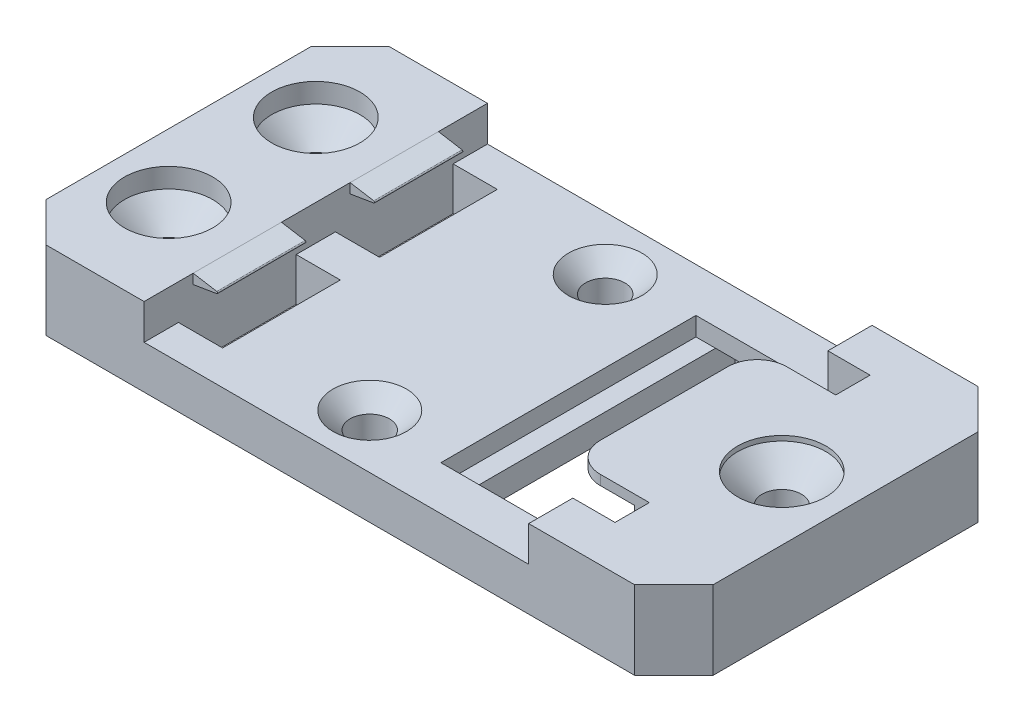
ISO-10303-21;
HEADER;
FILE_DESCRIPTION(('STEP AP214'),'2;1');
FILE_NAME('part.step','',(''),(''),'','','');
FILE_SCHEMA(('AUTOMOTIVE_DESIGN { 1 0 10303 214 1 1 1 1 }'));
ENDSEC;
DATA;
#1=APPLICATION_CONTEXT('core data for automotive mechanical design processes');
#2=APPLICATION_PROTOCOL_DEFINITION('international standard','automotive_design',2000,#1);
#3=PRODUCT_CONTEXT('',#1,'mechanical');
#4=PRODUCT('Part','Part','',(#3));
#5=PRODUCT_RELATED_PRODUCT_CATEGORY('part','',(#4));
#6=PRODUCT_DEFINITION_FORMATION('','',#4);
#7=PRODUCT_DEFINITION_CONTEXT('part definition',#1,'design');
#8=PRODUCT_DEFINITION('design','',#6,#7);
#9=PRODUCT_DEFINITION_SHAPE('','',#8);
#10=(LENGTH_UNIT() NAMED_UNIT(*) SI_UNIT(.MILLI.,.METRE.));
#11=(NAMED_UNIT(*) PLANE_ANGLE_UNIT() SI_UNIT($,.RADIAN.));
#12=(NAMED_UNIT(*) SI_UNIT($,.STERADIAN.) SOLID_ANGLE_UNIT());
#13=UNCERTAINTY_MEASURE_WITH_UNIT(LENGTH_MEASURE(1.E-05),#10,'distance_accuracy_value','');
#14=(GEOMETRIC_REPRESENTATION_CONTEXT(3) GLOBAL_UNCERTAINTY_ASSIGNED_CONTEXT((#13)) GLOBAL_UNIT_ASSIGNED_CONTEXT((#10,
#11,#12)) REPRESENTATION_CONTEXT('',''));
#15=CARTESIAN_POINT('',(0.,0.,0.));
#16=DIRECTION('',(0.,0.,1.));
#17=DIRECTION('',(1.,0.,0.));
#18=AXIS2_PLACEMENT_3D('',#15,#16,#17);
#19=CARTESIAN_POINT('',(19.55,2.184913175,2.908750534));
#20=DIRECTION('',(1.,0.,0.));
#21=DIRECTION('',(0.,0.,-1.));
#22=AXIS2_PLACEMENT_3D('',#19,#20,#21);
#23=PLANE('',#22);
#24=CARTESIAN_POINT('',(19.5499999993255,5.1,0.));
#25=DIRECTION('',(1.,0.,0.));
#26=DIRECTION('',(0.,1.,0.));
#27=AXIS2_PLACEMENT_3D('',#24,#25,#26);
#28=CIRCLE('',#27,2.9);
#29=CARTESIAN_POINT('',(19.5499999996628,4.71447077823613,-2.87425942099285));
#30=VERTEX_POINT('',#29);
#31=CARTESIAN_POINT('',(19.5499999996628,4.71447077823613,2.87425942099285));
#32=VERTEX_POINT('',#31);
#33=EDGE_CURVE('E21',#30,#32,#28,.F.);
#34=ORIENTED_EDGE('',*,*,#33,.T.);
#35=DIRECTION('',(0.,0.,-1.));
#36=VECTOR('',#35,1.);
#37=CARTESIAN_POINT('',(19.55,4.714470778,0.));
#38=LINE('',#37,#36);
#39=EDGE_CURVE('E425',#32,#30,#38,.T.);
#40=ORIENTED_EDGE('',*,*,#39,.T.);
#41=EDGE_LOOP('',(#34,#40));
#42=FACE_BOUND('',#41,.T.);
#43=ADVANCED_FACE('F17',(#42),#23,.F.);
#44=CARTESIAN_POINT('',(19.55,4.714470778,-2.9348));
#45=DIRECTION('',(0.573576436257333,0.819152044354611,0.));
#46=DIRECTION('',(-0.819152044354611,0.573576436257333,0.));
#47=AXIS2_PLACEMENT_3D('',#44,#45,#46);
#48=PLANE('',#47);
#49=ORIENTED_EDGE('',*,*,#39,.F.);
#50=CARTESIAN_POINT('',(18.9994072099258,5.1,0.));
#51=DIRECTION('',(0.573576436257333,0.819152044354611,0.));
#52=DIRECTION('',(0.819152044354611,-0.573576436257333,0.));
#53=AXIS2_PLACEMENT_3D('',#50,#51,#52);
#54=ELLIPSE('',#53,5.05599570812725,2.9);
#55=CARTESIAN_POINT('',(17.,6.5,2.53968501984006));
#56=VERTEX_POINT('',#55);
#57=EDGE_CURVE('E417',#32,#56,#54,.F.);
#58=ORIENTED_EDGE('',*,*,#57,.T.);
#59=DIRECTION('',(0.,0.,1.));
#60=VECTOR('',#59,1.);
#61=CARTESIAN_POINT('',(17.,6.5,0.));
#62=LINE('',#61,#60);
#63=CARTESIAN_POINT('',(17.,6.5,-2.53968501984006));
#64=VERTEX_POINT('',#63);
#65=EDGE_CURVE('E427',#64,#56,#62,.T.);
#66=ORIENTED_EDGE('',*,*,#65,.F.);
#67=CARTESIAN_POINT('',(18.9994072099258,5.1,0.));
#68=DIRECTION('',(0.573576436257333,0.819152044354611,0.));
#69=DIRECTION('',(0.819152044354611,-0.573576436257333,0.));
#70=AXIS2_PLACEMENT_3D('',#67,#68,#69);
#71=ELLIPSE('',#70,5.05599570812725,2.9);
#72=EDGE_CURVE('E422',#64,#30,#71,.F.);
#73=ORIENTED_EDGE('',*,*,#72,.T.);
#74=EDGE_LOOP('',(#49,#58,#66,#73));
#75=FACE_BOUND('',#74,.T.);
#76=ADVANCED_FACE('F424',(#75),#48,.F.);
#77=CARTESIAN_POINT('',(17.,6.5,-2.57016124));
#78=DIRECTION('',(-1.,0.,0.));
#79=DIRECTION('',(0.,0.,1.));
#80=AXIS2_PLACEMENT_3D('',#77,#78,#79);
#81=PLANE('',#80);
#82=DIRECTION('',(0.,0.,1.));
#83=VECTOR('',#82,1.);
#84=CARTESIAN_POINT('',(17.0000000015,7.,0.));
#85=LINE('',#84,#83);
#86=CARTESIAN_POINT('',(17.00000000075,7.,-2.19089022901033));
#87=VERTEX_POINT('',#86);
#88=CARTESIAN_POINT('',(17.00000000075,7.,2.19089022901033));
#89=VERTEX_POINT('',#88);
#90=EDGE_CURVE('E441',#87,#89,#85,.T.);
#91=ORIENTED_EDGE('',*,*,#90,.F.);
#92=CARTESIAN_POINT('',(17.,5.1,0.));
#93=DIRECTION('',(1.,0.,0.));
#94=DIRECTION('',(0.,0.,-1.));
#95=AXIS2_PLACEMENT_3D('',#92,#93,#94);
#96=CIRCLE('',#95,2.9);
#97=EDGE_CURVE('E430',#87,#64,#96,.F.);
#98=ORIENTED_EDGE('',*,*,#97,.T.);
#99=ORIENTED_EDGE('',*,*,#65,.T.);
#100=CARTESIAN_POINT('',(17.,5.1,0.));
#101=DIRECTION('',(1.,0.,0.));
#102=DIRECTION('',(0.,0.,-1.));
#103=AXIS2_PLACEMENT_3D('',#100,#101,#102);
#104=CIRCLE('',#103,2.9);
#105=EDGE_CURVE('E435',#56,#89,#104,.F.);
#106=ORIENTED_EDGE('',*,*,#105,.T.);
#107=EDGE_LOOP('',(#91,#98,#99,#106));
#108=FACE_BOUND('',#107,.T.);
#109=ADVANCED_FACE('F690',(#108),#81,.T.);
#110=CARTESIAN_POINT('',(-27.5,3.5,-7.5));
#111=DIRECTION('',(0.,1.,0.));
#112=DIRECTION('',(-1.,0.,0.));
#113=AXIS2_PLACEMENT_3D('',#110,#111,#112);
#114=CONICAL_SURFACE('',#113,2.,0.785398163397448);
#115=CARTESIAN_POINT('',(-27.5,6.,-7.5));
#116=DIRECTION('',(0.,1.,0.));
#117=DIRECTION('',(0.,0.,1.));
#118=AXIS2_PLACEMENT_3D('',#115,#116,#117);
#119=CIRCLE('',#118,4.5);
#120=CARTESIAN_POINT('',(-27.5,6.,-3.));
#121=VERTEX_POINT('',#120);
#122=EDGE_CURVE('E443',#121,#121,#119,.F.);
#123=ORIENTED_EDGE('',*,*,#122,.F.);
#124=EDGE_LOOP('',(#123));
#125=FACE_BOUND('',#124,.T.);
#126=CARTESIAN_POINT('',(-27.5,3.5,-7.5));
#127=DIRECTION('',(0.,1.,0.));
#128=DIRECTION('',(0.,0.,1.));
#129=AXIS2_PLACEMENT_3D('',#126,#127,#128);
#130=CIRCLE('',#129,2.);
#131=CARTESIAN_POINT('',(-27.5,3.5,-5.5));
#132=VERTEX_POINT('',#131);
#133=EDGE_CURVE('E735',#132,#132,#130,.T.);
#134=ORIENTED_EDGE('',*,*,#133,.F.);
#135=EDGE_LOOP('',(#134));
#136=FACE_BOUND('',#135,.T.);
#137=ADVANCED_FACE('F1351',(#125,#136),#114,.F.);
#138=CARTESIAN_POINT('',(-27.5,3.5,7.5));
#139=DIRECTION('',(0.,1.,0.));
#140=DIRECTION('',(-1.,0.,0.));
#141=AXIS2_PLACEMENT_3D('',#138,#139,#140);
#142=CONICAL_SURFACE('',#141,2.,0.785398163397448);
#143=CARTESIAN_POINT('',(-27.5,6.,7.5));
#144=DIRECTION('',(0.,1.,0.));
#145=DIRECTION('',(0.,0.,1.));
#146=AXIS2_PLACEMENT_3D('',#143,#144,#145);
#147=CIRCLE('',#146,4.5);
#148=CARTESIAN_POINT('',(-27.5,6.,12.));
#149=VERTEX_POINT('',#148);
#150=EDGE_CURVE('E447',#149,#149,#147,.F.);
#151=ORIENTED_EDGE('',*,*,#150,.F.);
#152=EDGE_LOOP('',(#151));
#153=FACE_BOUND('',#152,.T.);
#154=CARTESIAN_POINT('',(-27.5,3.5,7.5));
#155=DIRECTION('',(0.,1.,0.));
#156=DIRECTION('',(0.,0.,1.));
#157=AXIS2_PLACEMENT_3D('',#154,#155,#156);
#158=CIRCLE('',#157,2.);
#159=CARTESIAN_POINT('',(-27.5,3.5,9.5));
#160=VERTEX_POINT('',#159);
#161=EDGE_CURVE('E731',#160,#160,#158,.T.);
#162=ORIENTED_EDGE('',*,*,#161,.F.);
#163=EDGE_LOOP('',(#162));
#164=FACE_BOUND('',#163,.T.);
#165=ADVANCED_FACE('F1348',(#153,#164),#142,.F.);
#166=CARTESIAN_POINT('',(17.,5.1,0.));
#167=DIRECTION('',(1.,0.,0.));
#168=DIRECTION('',(0.,0.,-1.));
#169=AXIS2_PLACEMENT_3D('',#166,#167,#168);
#170=CYLINDRICAL_SURFACE('',#169,2.9);
#171=ORIENTED_EDGE('',*,*,#72,.F.);
#172=ORIENTED_EDGE('',*,*,#97,.F.);
#173=DIRECTION('',(-1.,0.,0.));
#174=VECTOR('',#173,1.);
#175=CARTESIAN_POINT('',(18.75,7.,-2.190890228));
#176=LINE('',#175,#174);
#177=CARTESIAN_POINT('',(22.,7.,-2.19089022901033));
#178=VERTEX_POINT('',#177);
#179=EDGE_CURVE('E446',#178,#87,#176,.T.);
#180=ORIENTED_EDGE('',*,*,#179,.F.);
#181=CARTESIAN_POINT('',(22.,5.1,0.));
#182=DIRECTION('',(1.,0.,0.));
#183=DIRECTION('',(0.,0.,-1.));
#184=AXIS2_PLACEMENT_3D('',#181,#182,#183);
#185=CIRCLE('',#184,2.9);
#186=CARTESIAN_POINT('',(22.,7.,2.19089022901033));
#187=VERTEX_POINT('',#186);
#188=EDGE_CURVE('E650',#178,#187,#185,.F.);
#189=ORIENTED_EDGE('',*,*,#188,.T.);
#190=DIRECTION('',(1.,0.,0.));
#191=VECTOR('',#190,1.);
#192=CARTESIAN_POINT('',(18.75,7.,2.190890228));
#193=LINE('',#192,#191);
#194=EDGE_CURVE('E699',#89,#187,#193,.T.);
#195=ORIENTED_EDGE('',*,*,#194,.F.);
#196=ORIENTED_EDGE('',*,*,#105,.F.);
#197=ORIENTED_EDGE('',*,*,#57,.F.);
#198=ORIENTED_EDGE('',*,*,#33,.F.);
#199=EDGE_LOOP('',(#171,#172,#180,#189,#195,#196,#197,#198));
#200=FACE_BOUND('',#199,.T.);
#201=ADVANCED_FACE('F434',(#200),#170,.T.);
#202=CARTESIAN_POINT('',(27.5,5.,0.));
#203=DIRECTION('',(0.,1.,0.));
#204=DIRECTION('',(-1.,0.,0.));
#205=AXIS2_PLACEMENT_3D('',#202,#203,#204);
#206=CONICAL_SURFACE('',#205,2.,0.785398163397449);
#207=CARTESIAN_POINT('',(27.5,7.5,0.));
#208=DIRECTION('',(0.,1.,0.));
#209=DIRECTION('',(0.,0.,1.));
#210=AXIS2_PLACEMENT_3D('',#207,#208,#209);
#211=CIRCLE('',#210,4.5);
#212=CARTESIAN_POINT('',(27.5,7.5,4.5));
#213=VERTEX_POINT('',#212);
#214=EDGE_CURVE('E738',#213,#213,#211,.F.);
#215=ORIENTED_EDGE('',*,*,#214,.F.);
#216=EDGE_LOOP('',(#215));
#217=FACE_BOUND('',#216,.T.);
#218=CARTESIAN_POINT('',(27.5,5.,0.));
#219=DIRECTION('',(0.,1.,0.));
#220=DIRECTION('',(0.,0.,1.));
#221=AXIS2_PLACEMENT_3D('',#218,#219,#220);
#222=CIRCLE('',#221,2.);
#223=CARTESIAN_POINT('',(27.5,5.,2.));
#224=VERTEX_POINT('',#223);
#225=EDGE_CURVE('E787',#224,#224,#222,.T.);
#226=ORIENTED_EDGE('',*,*,#225,.F.);
#227=EDGE_LOOP('',(#226));
#228=FACE_BOUND('',#227,.T.);
#229=ADVANCED_FACE('F1342',(#217,#228),#206,.F.);
#230=CARTESIAN_POINT('',(22.,4.4,-13.));
#231=DIRECTION('',(0.,1.,0.));
#232=DIRECTION('',(0.,0.,1.));
#233=AXIS2_PLACEMENT_3D('',#230,#231,#232);
#234=PLANE('',#233);
#235=DIRECTION('',(0.,0.,-1.));
#236=VECTOR('',#235,1.);
#237=CARTESIAN_POINT('',(23.5,4.4,-11.25));
#238=LINE('',#237,#236);
#239=CARTESIAN_POINT('',(23.5,4.4,-9.5));
#240=VERTEX_POINT('',#239);
#241=CARTESIAN_POINT('',(23.5,4.4,-13.));
#242=VERTEX_POINT('',#241);
#243=EDGE_CURVE('E786',#240,#242,#238,.T.);
#244=ORIENTED_EDGE('',*,*,#243,.T.);
#245=DIRECTION('',(-1.,0.,0.));
#246=VECTOR('',#245,1.);
#247=CARTESIAN_POINT('',(22.75,4.4,-13.));
#248=LINE('',#247,#246);
#249=CARTESIAN_POINT('',(22.0000000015,4.39999999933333,-13.));
#250=VERTEX_POINT('',#249);
#251=EDGE_CURVE('E429',#242,#250,#248,.T.);
#252=ORIENTED_EDGE('',*,*,#251,.T.);
#253=DIRECTION('',(0.,0.,1.));
#254=VECTOR('',#253,1.);
#255=CARTESIAN_POINT('',(22.,4.399999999,-9.479));
#256=LINE('',#255,#254);
#257=CARTESIAN_POINT('',(22.,4.39999999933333,-9.49999999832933));
#258=VERTEX_POINT('',#257);
#259=EDGE_CURVE('E906',#250,#258,#256,.T.);
#260=ORIENTED_EDGE('',*,*,#259,.T.);
#261=DIRECTION('',(1.,0.,0.));
#262=VECTOR('',#261,1.);
#263=CARTESIAN_POINT('',(21.,4.4,-9.5));
#264=LINE('',#263,#262);
#265=EDGE_CURVE('E792',#258,#240,#264,.T.);
#266=ORIENTED_EDGE('',*,*,#265,.T.);
#267=EDGE_LOOP('',(#244,#252,#260,#266));
#268=FACE_BOUND('',#267,.T.);
#269=ADVANCED_FACE('F1340',(#268),#234,.T.);
#270=CARTESIAN_POINT('',(31.75,4.,-6.));
#271=DIRECTION('',(-1.,0.,0.));
#272=DIRECTION('',(0.,0.,1.));
#273=AXIS2_PLACEMENT_3D('',#270,#271,#272);
#274=CYLINDRICAL_SURFACE('',#273,3.);
#275=DIRECTION('',(1.,0.,0.));
#276=VECTOR('',#275,1.);
#277=CARTESIAN_POINT('',(26.875,4.,-9.));
#278=LINE('',#277,#276);
#279=CARTESIAN_POINT('',(22.,4.,-8.999999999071));
#280=VERTEX_POINT('',#279);
#281=CARTESIAN_POINT('',(31.75,4.,-9.));
#282=VERTEX_POINT('',#281);
#283=EDGE_CURVE('E890',#280,#282,#278,.T.);
#284=ORIENTED_EDGE('',*,*,#283,.T.);
#285=CARTESIAN_POINT('',(31.75,4.,-6.));
#286=DIRECTION('',(-1.,0.,0.));
#287=DIRECTION('',(0.,0.,1.));
#288=AXIS2_PLACEMENT_3D('',#285,#286,#287);
#289=CIRCLE('',#288,3.);
#290=CARTESIAN_POINT('',(31.75,4.,-3.));
#291=VERTEX_POINT('',#290);
#292=EDGE_CURVE('E645',#282,#291,#289,.F.);
#293=ORIENTED_EDGE('',*,*,#292,.T.);
#294=DIRECTION('',(-1.,0.,0.));
#295=VECTOR('',#294,1.);
#296=CARTESIAN_POINT('',(26.875,4.,-3.));
#297=LINE('',#296,#295);
#298=CARTESIAN_POINT('',(22.,4.,-3.));
#299=VERTEX_POINT('',#298);
#300=EDGE_CURVE('E652',#291,#299,#297,.T.);
#301=ORIENTED_EDGE('',*,*,#300,.T.);
#302=CARTESIAN_POINT('',(22.,4.,-6.));
#303=DIRECTION('',(-1.,0.,0.));
#304=DIRECTION('',(0.,0.,1.));
#305=AXIS2_PLACEMENT_3D('',#302,#303,#304);
#306=CIRCLE('',#305,3.);
#307=CARTESIAN_POINT('',(22.,7.,-5.99999999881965));
#308=VERTEX_POINT('',#307);
#309=EDGE_CURVE('E654',#299,#308,#306,.T.);
#310=ORIENTED_EDGE('',*,*,#309,.T.);
#311=CARTESIAN_POINT('',(22.,4.,-6.));
#312=DIRECTION('',(-1.,0.,0.));
#313=DIRECTION('',(0.,0.,1.));
#314=AXIS2_PLACEMENT_3D('',#311,#312,#313);
#315=CIRCLE('',#314,3.);
#316=EDGE_CURVE('E640',#308,#280,#315,.T.);
#317=ORIENTED_EDGE('',*,*,#316,.T.);
#318=EDGE_LOOP('',(#284,#293,#301,#310,#317));
#319=FACE_BOUND('',#318,.T.);
#320=ADVANCED_FACE('F1337',(#319),#274,.F.);
#321=CARTESIAN_POINT('',(-20.,6.994,12.5));
#322=DIRECTION('',(0.,0.,1.));
#323=DIRECTION('',(1.,0.,0.));
#324=AXIS2_PLACEMENT_3D('',#321,#322,#323);
#325=PLANE('',#324);
#326=DIRECTION('',(-0.986393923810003,0.164398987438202,0.));
#327=VECTOR('',#326,1.);
#328=CARTESIAN_POINT('',(-18.795918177,7.799319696,12.5));
#329=LINE('',#328,#327);
#330=CARTESIAN_POINT('',(-17.5918363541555,7.59863939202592,12.5));
#331=VERTEX_POINT('',#330);
#332=CARTESIAN_POINT('',(-20.,7.999999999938,12.4999999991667));
#333=VERTEX_POINT('',#332);
#334=EDGE_CURVE('E450',#331,#333,#329,.T.);
#335=ORIENTED_EDGE('',*,*,#334,.T.);
#336=DIRECTION('',(0.,-1.,0.));
#337=VECTOR('',#336,1.);
#338=CARTESIAN_POINT('',(-20.,7.5,12.5));
#339=LINE('',#338,#337);
#340=CARTESIAN_POINT('',(-20.,7.,12.4999999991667));
#341=VERTEX_POINT('',#340);
#342=EDGE_CURVE('E686',#333,#341,#339,.T.);
#343=ORIENTED_EDGE('',*,*,#342,.T.);
#344=DIRECTION('',(0.986393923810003,0.164398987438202,0.));
#345=VECTOR('',#344,1.);
#346=CARTESIAN_POINT('',(-18.795918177,7.200680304,12.5));
#347=LINE('',#346,#345);
#348=CARTESIAN_POINT('',(-17.5918363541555,7.40136060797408,12.5));
#349=VERTEX_POINT('',#348);
#350=EDGE_CURVE('E565',#341,#349,#347,.T.);
#351=ORIENTED_EDGE('',*,*,#350,.T.);
#352=CARTESIAN_POINT('',(-17.608276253,7.5,12.5));
#353=DIRECTION('',(0.,0.,-1.));
#354=DIRECTION('',(-1.,0.,0.));
#355=AXIS2_PLACEMENT_3D('',#352,#353,#354);
#356=CIRCLE('',#355,0.0999999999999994);
#357=EDGE_CURVE('E685',#349,#331,#356,.F.);
#358=ORIENTED_EDGE('',*,*,#357,.T.);
#359=EDGE_LOOP('',(#335,#343,#351,#358));
#360=FACE_BOUND('',#359,.T.);
#361=ADVANCED_FACE('F1335',(#360),#325,.T.);
#362=CARTESIAN_POINT('',(-17.608276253,7.5,12.5));
#363=DIRECTION('',(0.,0.,-1.));
#364=DIRECTION('',(-1.,0.,0.));
#365=AXIS2_PLACEMENT_3D('',#362,#363,#364);
#366=CYLINDRICAL_SURFACE('',#365,0.0999999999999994);
#367=DIRECTION('',(0.,0.,-1.));
#368=VECTOR('',#367,1.);
#369=CARTESIAN_POINT('',(-17.591836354,7.401360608,8.));
#370=LINE('',#369,#368);
#371=CARTESIAN_POINT('',(-17.5918363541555,7.40136060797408,3.5));
#372=VERTEX_POINT('',#371);
#373=EDGE_CURVE('E869',#349,#372,#370,.T.);
#374=ORIENTED_EDGE('',*,*,#373,.T.);
#375=CARTESIAN_POINT('',(-17.608276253,7.5,3.5));
#376=DIRECTION('',(0.,0.,-1.));
#377=DIRECTION('',(-1.,0.,0.));
#378=AXIS2_PLACEMENT_3D('',#375,#376,#377);
#379=CIRCLE('',#378,0.0999999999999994);
#380=CARTESIAN_POINT('',(-17.5918363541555,7.59863939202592,3.5));
#381=VERTEX_POINT('',#380);
#382=EDGE_CURVE('E682',#372,#381,#379,.F.);
#383=ORIENTED_EDGE('',*,*,#382,.T.);
#384=DIRECTION('',(0.,0.,1.));
#385=VECTOR('',#384,1.);
#386=CARTESIAN_POINT('',(-17.591836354,7.598639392,8.));
#387=LINE('',#386,#385);
#388=EDGE_CURVE('E451',#381,#331,#387,.T.);
#389=ORIENTED_EDGE('',*,*,#388,.T.);
#390=ORIENTED_EDGE('',*,*,#357,.F.);
#391=EDGE_LOOP('',(#374,#383,#389,#390));
#392=FACE_BOUND('',#391,.T.);
#393=ADVANCED_FACE('F1331',(#392),#366,.T.);
#394=CARTESIAN_POINT('',(-20.,6.994,3.5));
#395=DIRECTION('',(0.,0.,1.));
#396=DIRECTION('',(1.,0.,0.));
#397=AXIS2_PLACEMENT_3D('',#394,#395,#396);
#398=PLANE('',#397);
#399=ORIENTED_EDGE('',*,*,#382,.F.);
#400=DIRECTION('',(-0.986393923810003,-0.164398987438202,0.));
#401=VECTOR('',#400,1.);
#402=CARTESIAN_POINT('',(-18.795918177,7.200680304,3.5));
#403=LINE('',#402,#401);
#404=CARTESIAN_POINT('',(-20.,7.,3.5));
#405=VERTEX_POINT('',#404);
#406=EDGE_CURVE('E863',#372,#405,#403,.T.);
#407=ORIENTED_EDGE('',*,*,#406,.T.);
#408=DIRECTION('',(0.,-1.,0.));
#409=VECTOR('',#408,1.);
#410=CARTESIAN_POINT('',(-20.,7.5,3.5));
#411=LINE('',#410,#409);
#412=CARTESIAN_POINT('',(-20.,7.999999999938,3.5));
#413=VERTEX_POINT('',#412);
#414=EDGE_CURVE('E684',#413,#405,#411,.T.);
#415=ORIENTED_EDGE('',*,*,#414,.F.);
#416=DIRECTION('',(0.986393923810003,-0.164398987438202,0.));
#417=VECTOR('',#416,1.);
#418=CARTESIAN_POINT('',(-18.795918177,7.799319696,3.5));
#419=LINE('',#418,#417);
#420=EDGE_CURVE('E454',#413,#381,#419,.T.);
#421=ORIENTED_EDGE('',*,*,#420,.T.);
#422=EDGE_LOOP('',(#399,#407,#415,#421));
#423=FACE_BOUND('',#422,.T.);
#424=ADVANCED_FACE('F1334',(#423),#398,.F.);
#425=CARTESIAN_POINT('',(-20.,8.006,-12.5));
#426=DIRECTION('',(0.,0.,-1.));
#427=DIRECTION('',(1.,0.,0.));
#428=AXIS2_PLACEMENT_3D('',#425,#426,#427);
#429=PLANE('',#428);
#430=DIRECTION('',(0.986393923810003,0.164398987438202,0.));
#431=VECTOR('',#430,1.);
#432=CARTESIAN_POINT('',(-18.795918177,7.200680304,-12.5));
#433=LINE('',#432,#431);
#434=CARTESIAN_POINT('',(-20.,7.,-12.4999999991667));
#435=VERTEX_POINT('',#434);
#436=CARTESIAN_POINT('',(-17.5918363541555,7.40136060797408,-12.5));
#437=VERTEX_POINT('',#436);
#438=EDGE_CURVE('E850',#435,#437,#433,.T.);
#439=ORIENTED_EDGE('',*,*,#438,.F.);
#440=DIRECTION('',(0.,1.,0.));
#441=VECTOR('',#440,1.);
#442=CARTESIAN_POINT('',(-20.,7.5,-12.5));
#443=LINE('',#442,#441);
#444=CARTESIAN_POINT('',(-20.,7.999999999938,-12.4999999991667));
#445=VERTEX_POINT('',#444);
#446=EDGE_CURVE('E681',#435,#445,#443,.T.);
#447=ORIENTED_EDGE('',*,*,#446,.T.);
#448=DIRECTION('',(-0.986393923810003,0.164398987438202,0.));
#449=VECTOR('',#448,1.);
#450=CARTESIAN_POINT('',(-18.795918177,7.799319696,-12.5));
#451=LINE('',#450,#449);
#452=CARTESIAN_POINT('',(-17.5918363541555,7.59863939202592,-12.5));
#453=VERTEX_POINT('',#452);
#454=EDGE_CURVE('E475',#453,#445,#451,.T.);
#455=ORIENTED_EDGE('',*,*,#454,.F.);
#456=CARTESIAN_POINT('',(-17.608276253,7.5,-12.5));
#457=DIRECTION('',(0.,0.,1.));
#458=DIRECTION('',(1.,0.,0.));
#459=AXIS2_PLACEMENT_3D('',#456,#457,#458);
#460=CIRCLE('',#459,0.0999999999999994);
#461=EDGE_CURVE('E678',#453,#437,#460,.F.);
#462=ORIENTED_EDGE('',*,*,#461,.T.);
#463=EDGE_LOOP('',(#439,#447,#455,#462));
#464=FACE_BOUND('',#463,.T.);
#465=ADVANCED_FACE('F1329',(#464),#429,.T.);
#466=CARTESIAN_POINT('',(-17.608276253,7.5,-12.5));
#467=DIRECTION('',(0.,0.,1.));
#468=DIRECTION('',(1.,0.,0.));
#469=AXIS2_PLACEMENT_3D('',#466,#467,#468);
#470=CYLINDRICAL_SURFACE('',#469,0.0999999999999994);
#471=ORIENTED_EDGE('',*,*,#461,.F.);
#472=DIRECTION('',(0.,0.,-1.));
#473=VECTOR('',#472,1.);
#474=CARTESIAN_POINT('',(-17.591836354,7.598639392,-8.));
#475=LINE('',#474,#473);
#476=CARTESIAN_POINT('',(-17.5918363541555,7.59863939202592,-3.5));
#477=VERTEX_POINT('',#476);
#478=EDGE_CURVE('E484',#477,#453,#475,.T.);
#479=ORIENTED_EDGE('',*,*,#478,.F.);
#480=CARTESIAN_POINT('',(-17.608276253,7.5,-3.5));
#481=DIRECTION('',(0.,0.,1.));
#482=DIRECTION('',(1.,0.,0.));
#483=AXIS2_PLACEMENT_3D('',#480,#481,#482);
#484=CIRCLE('',#483,0.0999999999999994);
#485=CARTESIAN_POINT('',(-17.5918363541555,7.40136060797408,-3.5));
#486=VERTEX_POINT('',#485);
#487=EDGE_CURVE('E505',#477,#486,#484,.F.);
#488=ORIENTED_EDGE('',*,*,#487,.T.);
#489=DIRECTION('',(0.,0.,1.));
#490=VECTOR('',#489,1.);
#491=CARTESIAN_POINT('',(-17.591836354,7.401360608,-8.));
#492=LINE('',#491,#490);
#493=EDGE_CURVE('E848',#437,#486,#492,.T.);
#494=ORIENTED_EDGE('',*,*,#493,.F.);
#495=EDGE_LOOP('',(#471,#479,#488,#494));
#496=FACE_BOUND('',#495,.T.);
#497=ADVANCED_FACE('F1325',(#496),#470,.T.);
#498=CARTESIAN_POINT('',(-20.,8.006,-3.5));
#499=DIRECTION('',(0.,0.,-1.));
#500=DIRECTION('',(1.,0.,0.));
#501=AXIS2_PLACEMENT_3D('',#498,#499,#500);
#502=PLANE('',#501);
#503=ORIENTED_EDGE('',*,*,#487,.F.);
#504=DIRECTION('',(0.986393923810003,-0.164398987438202,0.));
#505=VECTOR('',#504,1.);
#506=CARTESIAN_POINT('',(-18.795918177,7.799319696,-3.5));
#507=LINE('',#506,#505);
#508=CARTESIAN_POINT('',(-20.,7.999999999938,-3.5));
#509=VERTEX_POINT('',#508);
#510=EDGE_CURVE('E487',#509,#477,#507,.T.);
#511=ORIENTED_EDGE('',*,*,#510,.F.);
#512=DIRECTION('',(0.,1.,0.));
#513=VECTOR('',#512,1.);
#514=CARTESIAN_POINT('',(-20.,7.5,-3.5));
#515=LINE('',#514,#513);
#516=CARTESIAN_POINT('',(-20.,7.,-3.5));
#517=VERTEX_POINT('',#516);
#518=EDGE_CURVE('E677',#517,#509,#515,.T.);
#519=ORIENTED_EDGE('',*,*,#518,.F.);
#520=DIRECTION('',(-0.986393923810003,-0.164398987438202,0.));
#521=VECTOR('',#520,1.);
#522=CARTESIAN_POINT('',(-18.795918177,7.200680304,-3.5));
#523=LINE('',#522,#521);
#524=EDGE_CURVE('E547',#486,#517,#523,.T.);
#525=ORIENTED_EDGE('',*,*,#524,.F.);
#526=EDGE_LOOP('',(#503,#511,#519,#525));
#527=FACE_BOUND('',#526,.T.);
#528=ADVANCED_FACE('F1328',(#527),#502,.F.);
#529=CARTESIAN_POINT('',(-17.591836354,7.598639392,-12.5));
#530=DIRECTION('',(0.164398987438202,0.986393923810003,0.));
#531=DIRECTION('',(-0.986393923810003,0.164398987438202,0.));
#532=AXIS2_PLACEMENT_3D('',#529,#530,#531);
#533=PLANE('',#532);
#534=ORIENTED_EDGE('',*,*,#454,.T.);
#535=DIRECTION('',(0.,0.,1.));
#536=VECTOR('',#535,1.);
#537=CARTESIAN_POINT('',(-20.,8.,0.));
#538=LINE('',#537,#536);
#539=EDGE_CURVE('E463',#445,#509,#538,.T.);
#540=ORIENTED_EDGE('',*,*,#539,.T.);
#541=ORIENTED_EDGE('',*,*,#510,.T.);
#542=ORIENTED_EDGE('',*,*,#478,.T.);
#543=EDGE_LOOP('',(#534,#540,#541,#542));
#544=FACE_BOUND('',#543,.T.);
#545=ADVANCED_FACE('F1376',(#544),#533,.T.);
#546=CARTESIAN_POINT('',(-20.,8.,3.5));
#547=DIRECTION('',(-0.164398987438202,-0.986393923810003,0.));
#548=DIRECTION('',(0.986393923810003,-0.164398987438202,0.));
#549=AXIS2_PLACEMENT_3D('',#546,#547,#548);
#550=PLANE('',#549);
#551=ORIENTED_EDGE('',*,*,#388,.F.);
#552=ORIENTED_EDGE('',*,*,#420,.F.);
#553=DIRECTION('',(0.,0.,1.));
#554=VECTOR('',#553,1.);
#555=CARTESIAN_POINT('',(-20.,8.,0.));
#556=LINE('',#555,#554);
#557=EDGE_CURVE('E459',#413,#333,#556,.T.);
#558=ORIENTED_EDGE('',*,*,#557,.T.);
#559=ORIENTED_EDGE('',*,*,#334,.F.);
#560=EDGE_LOOP('',(#551,#552,#558,#559));
#561=FACE_BOUND('',#560,.T.);
#562=ADVANCED_FACE('F1323',(#561),#550,.F.);
#563=CARTESIAN_POINT('',(-27.5,6.,7.5));
#564=DIRECTION('',(0.,1.,0.));
#565=DIRECTION('',(0.,0.,1.));
#566=AXIS2_PLACEMENT_3D('',#563,#564,#565);
#567=CYLINDRICAL_SURFACE('',#566,4.5);
#568=ORIENTED_EDGE('',*,*,#150,.T.);
#569=EDGE_LOOP('',(#568));
#570=FACE_BOUND('',#569,.T.);
#571=CARTESIAN_POINT('',(-27.5,8.,7.5));
#572=DIRECTION('',(0.,1.,0.));
#573=DIRECTION('',(0.,0.,1.));
#574=AXIS2_PLACEMENT_3D('',#571,#572,#573);
#575=CIRCLE('',#574,4.5);
#576=CARTESIAN_POINT('',(-27.5,8.,12.));
#577=VERTEX_POINT('',#576);
#578=EDGE_CURVE('E462',#577,#577,#575,.T.);
#579=ORIENTED_EDGE('',*,*,#578,.T.);
#580=EDGE_LOOP('',(#579));
#581=FACE_BOUND('',#580,.T.);
#582=ADVANCED_FACE('F1319',(#570,#581),#567,.F.);
#583=CARTESIAN_POINT('',(-27.5,6.,-7.5));
#584=DIRECTION('',(0.,1.,0.));
#585=DIRECTION('',(0.,0.,1.));
#586=AXIS2_PLACEMENT_3D('',#583,#584,#585);
#587=CYLINDRICAL_SURFACE('',#586,4.5);
#588=ORIENTED_EDGE('',*,*,#122,.T.);
#589=EDGE_LOOP('',(#588));
#590=FACE_BOUND('',#589,.T.);
#591=CARTESIAN_POINT('',(-27.5,8.,-7.5));
#592=DIRECTION('',(0.,1.,0.));
#593=DIRECTION('',(0.,0.,1.));
#594=AXIS2_PLACEMENT_3D('',#591,#592,#593);
#595=CIRCLE('',#594,4.5);
#596=CARTESIAN_POINT('',(-27.5,8.,-3.));
#597=VERTEX_POINT('',#596);
#598=EDGE_CURVE('E630',#597,#597,#595,.T.);
#599=ORIENTED_EDGE('',*,*,#598,.T.);
#600=EDGE_LOOP('',(#599));
#601=FACE_BOUND('',#600,.T.);
#602=ADVANCED_FACE('F1315',(#590,#601),#587,.F.);
#603=CARTESIAN_POINT('',(31.75,4.,6.));
#604=DIRECTION('',(-1.,0.,0.));
#605=DIRECTION('',(0.,0.,1.));
#606=AXIS2_PLACEMENT_3D('',#603,#604,#605);
#607=CYLINDRICAL_SURFACE('',#606,3.);
#608=DIRECTION('',(1.,0.,0.));
#609=VECTOR('',#608,1.);
#610=CARTESIAN_POINT('',(26.875,4.,3.));
#611=LINE('',#610,#609);
#612=CARTESIAN_POINT('',(22.,4.,2.999999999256));
#613=VERTEX_POINT('',#612);
#614=CARTESIAN_POINT('',(31.75,4.,3.));
#615=VERTEX_POINT('',#614);
#616=EDGE_CURVE('E704',#613,#615,#611,.T.);
#617=ORIENTED_EDGE('',*,*,#616,.T.);
#618=CARTESIAN_POINT('',(31.75,4.,6.));
#619=DIRECTION('',(-1.,0.,0.));
#620=DIRECTION('',(0.,0.,1.));
#621=AXIS2_PLACEMENT_3D('',#618,#619,#620);
#622=CIRCLE('',#621,3.);
#623=CARTESIAN_POINT('',(31.75,4.,9.));
#624=VERTEX_POINT('',#623);
#625=EDGE_CURVE('E662',#615,#624,#622,.F.);
#626=ORIENTED_EDGE('',*,*,#625,.T.);
#627=DIRECTION('',(-1.,0.,0.));
#628=VECTOR('',#627,1.);
#629=CARTESIAN_POINT('',(26.875,4.,9.));
#630=LINE('',#629,#628);
#631=CARTESIAN_POINT('',(22.,4.,8.999999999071));
#632=VERTEX_POINT('',#631);
#633=EDGE_CURVE('E809',#624,#632,#630,.T.);
#634=ORIENTED_EDGE('',*,*,#633,.T.);
#635=CARTESIAN_POINT('',(22.,4.,6.));
#636=DIRECTION('',(-1.,0.,0.));
#637=DIRECTION('',(0.,0.,1.));
#638=AXIS2_PLACEMENT_3D('',#635,#636,#637);
#639=CIRCLE('',#638,3.);
#640=CARTESIAN_POINT('',(22.,7.,6.00000000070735));
#641=VERTEX_POINT('',#640);
#642=EDGE_CURVE('E625',#632,#641,#639,.T.);
#643=ORIENTED_EDGE('',*,*,#642,.T.);
#644=CARTESIAN_POINT('',(22.,4.,6.));
#645=DIRECTION('',(-1.,0.,0.));
#646=DIRECTION('',(0.,0.,1.));
#647=AXIS2_PLACEMENT_3D('',#644,#645,#646);
#648=CIRCLE('',#647,3.);
#649=EDGE_CURVE('E658',#641,#613,#648,.T.);
#650=ORIENTED_EDGE('',*,*,#649,.T.);
#651=EDGE_LOOP('',(#617,#626,#634,#643,#650));
#652=FACE_BOUND('',#651,.T.);
#653=ADVANCED_FACE('F1312',(#652),#607,.F.);
#654=CARTESIAN_POINT('',(15.5,7.,9.5));
#655=DIRECTION('',(0.,-1.,0.));
#656=DIRECTION('',(0.,0.,-1.));
#657=AXIS2_PLACEMENT_3D('',#654,#655,#656);
#658=PLANE('',#657);
#659=DIRECTION('',(1.,0.,0.));
#660=VECTOR('',#659,1.);
#661=CARTESIAN_POINT('',(21.,6.9999999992,-9.5));
#662=LINE('',#661,#660);
#663=CARTESIAN_POINT('',(18.5,6.9999999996,-9.5));
#664=VERTEX_POINT('',#663);
#665=CARTESIAN_POINT('',(22.,6.99999999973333,-9.49999999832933));
#666=VERTEX_POINT('',#665);
#667=EDGE_CURVE('E778',#664,#666,#662,.T.);
#668=ORIENTED_EDGE('',*,*,#667,.T.);
#669=DIRECTION('',(0.,0.,1.));
#670=VECTOR('',#669,1.);
#671=CARTESIAN_POINT('',(22.,7.,-9.479));
#672=LINE('',#671,#670);
#673=EDGE_CURVE('E644',#666,#308,#672,.T.);
#674=ORIENTED_EDGE('',*,*,#673,.T.);
#675=DIRECTION('',(0.,0.,1.));
#676=VECTOR('',#675,1.);
#677=CARTESIAN_POINT('',(22.,7.,0.));
#678=LINE('',#677,#676);
#679=EDGE_CURVE('E653',#308,#178,#678,.T.);
#680=ORIENTED_EDGE('',*,*,#679,.T.);
#681=ORIENTED_EDGE('',*,*,#179,.T.);
#682=ORIENTED_EDGE('',*,*,#90,.T.);
#683=ORIENTED_EDGE('',*,*,#194,.T.);
#684=DIRECTION('',(0.,0.,1.));
#685=VECTOR('',#684,1.);
#686=CARTESIAN_POINT('',(22.,7.,0.));
#687=LINE('',#686,#685);
#688=EDGE_CURVE('E661',#187,#641,#687,.T.);
#689=ORIENTED_EDGE('',*,*,#688,.T.);
#690=DIRECTION('',(0.,0.,1.));
#691=VECTOR('',#690,1.);
#692=CARTESIAN_POINT('',(22.,7.,9.479));
#693=LINE('',#692,#691);
#694=CARTESIAN_POINT('',(22.,6.99999999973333,9.49999999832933));
#695=VERTEX_POINT('',#694);
#696=EDGE_CURVE('E628',#641,#695,#693,.T.);
#697=ORIENTED_EDGE('',*,*,#696,.T.);
#698=DIRECTION('',(-1.,0.,0.));
#699=VECTOR('',#698,1.);
#700=CARTESIAN_POINT('',(21.,6.9999999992,9.5));
#701=LINE('',#700,#699);
#702=CARTESIAN_POINT('',(18.4999999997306,6.9999999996,9.5));
#703=VERTEX_POINT('',#702);
#704=EDGE_CURVE('E755',#695,#703,#701,.T.);
#705=ORIENTED_EDGE('',*,*,#704,.T.);
#706=CARTESIAN_POINT('',(18.5,7.,6.5));
#707=DIRECTION('',(0.,1.,0.));
#708=DIRECTION('',(-1.,0.,0.));
#709=AXIS2_PLACEMENT_3D('',#706,#707,#708);
#710=CIRCLE('',#709,3.);
#711=CARTESIAN_POINT('',(15.5,7.,6.5));
#712=VERTEX_POINT('',#711);
#713=EDGE_CURVE('E667',#703,#712,#710,.F.);
#714=ORIENTED_EDGE('',*,*,#713,.T.);
#715=DIRECTION('',(0.,0.,-1.));
#716=VECTOR('',#715,1.);
#717=CARTESIAN_POINT('',(15.5,7.,0.));
#718=LINE('',#717,#716);
#719=CARTESIAN_POINT('',(15.5,7.,-6.5));
#720=VERTEX_POINT('',#719);
#721=EDGE_CURVE('E740',#712,#720,#718,.T.);
#722=ORIENTED_EDGE('',*,*,#721,.T.);
#723=CARTESIAN_POINT('',(18.5,7.,-6.5));
#724=DIRECTION('',(0.,1.,0.));
#725=DIRECTION('',(-1.,0.,0.));
#726=AXIS2_PLACEMENT_3D('',#723,#724,#725);
#727=CIRCLE('',#726,3.);
#728=EDGE_CURVE('E671',#720,#664,#727,.F.);
#729=ORIENTED_EDGE('',*,*,#728,.T.);
#730=EDGE_LOOP('',(#668,#674,#680,#681,#682,#683,#689,#697,#705,#714,#722,#729));
#731=FACE_BOUND('',#730,.T.);
#732=ADVANCED_FACE('F695',(#731),#658,.T.);
#733=CARTESIAN_POINT('',(22.,4.4,9.5));
#734=DIRECTION('',(0.,1.,0.));
#735=DIRECTION('',(0.,0.,1.));
#736=AXIS2_PLACEMENT_3D('',#733,#734,#735);
#737=PLANE('',#736);
#738=DIRECTION('',(0.,0.,-1.));
#739=VECTOR('',#738,1.);
#740=CARTESIAN_POINT('',(23.5,4.4,11.25));
#741=LINE('',#740,#739);
#742=CARTESIAN_POINT('',(23.5,4.39999999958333,13.));
#743=VERTEX_POINT('',#742);
#744=CARTESIAN_POINT('',(23.5,4.4,9.5));
#745=VERTEX_POINT('',#744);
#746=EDGE_CURVE('E761',#743,#745,#741,.T.);
#747=ORIENTED_EDGE('',*,*,#746,.T.);
#748=DIRECTION('',(-1.,0.,0.));
#749=VECTOR('',#748,1.);
#750=CARTESIAN_POINT('',(21.,4.4,9.5));
#751=LINE('',#750,#749);
#752=CARTESIAN_POINT('',(22.,4.39999999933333,9.49999999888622));
#753=VERTEX_POINT('',#752);
#754=EDGE_CURVE('E790',#745,#753,#751,.T.);
#755=ORIENTED_EDGE('',*,*,#754,.T.);
#756=DIRECTION('',(0.,0.,1.));
#757=VECTOR('',#756,1.);
#758=CARTESIAN_POINT('',(22.,4.399999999,9.479));
#759=LINE('',#758,#757);
#760=CARTESIAN_POINT('',(22.0000000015,4.39999999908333,13.));
#761=VERTEX_POINT('',#760);
#762=EDGE_CURVE('E805',#753,#761,#759,.T.);
#763=ORIENTED_EDGE('',*,*,#762,.T.);
#764=DIRECTION('',(1.,0.,0.));
#765=VECTOR('',#764,1.);
#766=CARTESIAN_POINT('',(22.75,4.4,13.));
#767=LINE('',#766,#765);
#768=EDGE_CURVE('E674',#761,#743,#767,.T.);
#769=ORIENTED_EDGE('',*,*,#768,.T.);
#770=EDGE_LOOP('',(#747,#755,#763,#769));
#771=FACE_BOUND('',#770,.T.);
#772=ADVANCED_FACE('F1310',(#771),#737,.T.);
#773=CARTESIAN_POINT('',(18.5,7.,-6.5));
#774=DIRECTION('',(0.,1.,0.));
#775=DIRECTION('',(-1.,0.,0.));
#776=AXIS2_PLACEMENT_3D('',#773,#774,#775);
#777=CYLINDRICAL_SURFACE('',#776,3.);
#778=ORIENTED_EDGE('',*,*,#728,.F.);
#779=DIRECTION('',(0.,1.,0.));
#780=VECTOR('',#779,1.);
#781=CARTESIAN_POINT('',(15.5,7.5,-6.5));
#782=LINE('',#781,#780);
#783=CARTESIAN_POINT('',(15.5,8.,-6.5));
#784=VERTEX_POINT('',#783);
#785=EDGE_CURVE('E669',#720,#784,#782,.T.);
#786=ORIENTED_EDGE('',*,*,#785,.T.);
#787=CARTESIAN_POINT('',(18.5,8.,-6.5));
#788=DIRECTION('',(0.,1.,0.));
#789=DIRECTION('',(-1.,0.,0.));
#790=AXIS2_PLACEMENT_3D('',#787,#788,#789);
#791=CIRCLE('',#790,3.);
#792=CARTESIAN_POINT('',(18.5,8.,-9.4999999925));
#793=VERTEX_POINT('',#792);
#794=EDGE_CURVE('E620',#784,#793,#791,.F.);
#795=ORIENTED_EDGE('',*,*,#794,.T.);
#796=DIRECTION('',(0.,-1.,0.));
#797=VECTOR('',#796,1.);
#798=CARTESIAN_POINT('',(18.5,6.2,-9.5));
#799=LINE('',#798,#797);
#800=EDGE_CURVE('E673',#793,#664,#799,.T.);
#801=ORIENTED_EDGE('',*,*,#800,.T.);
#802=EDGE_LOOP('',(#778,#786,#795,#801));
#803=FACE_BOUND('',#802,.T.);
#804=ADVANCED_FACE('F1306',(#803),#777,.T.);
#805=CARTESIAN_POINT('',(18.5,4.4,-9.5));
#806=DIRECTION('',(0.,0.,1.));
#807=DIRECTION('',(1.,0.,0.));
#808=AXIS2_PLACEMENT_3D('',#805,#806,#807);
#809=PLANE('',#808);
#810=DIRECTION('',(0.,1.,0.));
#811=VECTOR('',#810,1.);
#812=CARTESIAN_POINT('',(22.,4.75,-9.499999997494));
#813=LINE('',#812,#811);
#814=EDGE_CURVE('E903',#258,#666,#813,.T.);
#815=ORIENTED_EDGE('',*,*,#814,.T.);
#816=ORIENTED_EDGE('',*,*,#667,.F.);
#817=ORIENTED_EDGE('',*,*,#800,.F.);
#818=DIRECTION('',(1.,0.,0.));
#819=VECTOR('',#818,1.);
#820=CARTESIAN_POINT('',(24.75,8.,-9.499999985));
#821=LINE('',#820,#819);
#822=CARTESIAN_POINT('',(23.4999999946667,8.,-9.49999999));
#823=VERTEX_POINT('',#822);
#824=EDGE_CURVE('E623',#793,#823,#821,.T.);
#825=ORIENTED_EDGE('',*,*,#824,.T.);
#826=DIRECTION('',(0.,-1.,0.));
#827=VECTOR('',#826,1.);
#828=CARTESIAN_POINT('',(23.5,6.2,-9.5));
#829=LINE('',#828,#827);
#830=EDGE_CURVE('E783',#823,#240,#829,.T.);
#831=ORIENTED_EDGE('',*,*,#830,.T.);
#832=ORIENTED_EDGE('',*,*,#265,.F.);
#833=EDGE_LOOP('',(#815,#816,#817,#825,#831,#832));
#834=FACE_BOUND('',#833,.T.);
#835=ADVANCED_FACE('F1309',(#834),#809,.F.);
#836=CARTESIAN_POINT('',(23.5,4.4,9.5));
#837=DIRECTION('',(0.,0.,-1.));
#838=DIRECTION('',(-1.,0.,0.));
#839=AXIS2_PLACEMENT_3D('',#836,#837,#838);
#840=PLANE('',#839);
#841=DIRECTION('',(0.,-1.,0.));
#842=VECTOR('',#841,1.);
#843=CARTESIAN_POINT('',(22.,4.75,9.499999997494));
#844=LINE('',#843,#842);
#845=EDGE_CURVE('E802',#695,#753,#844,.T.);
#846=ORIENTED_EDGE('',*,*,#845,.T.);
#847=ORIENTED_EDGE('',*,*,#754,.F.);
#848=DIRECTION('',(0.,1.,0.));
#849=VECTOR('',#848,1.);
#850=CARTESIAN_POINT('',(23.5,6.2,9.5));
#851=LINE('',#850,#849);
#852=CARTESIAN_POINT('',(23.4999999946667,8.,9.49999999));
#853=VERTEX_POINT('',#852);
#854=EDGE_CURVE('E624',#745,#853,#851,.T.);
#855=ORIENTED_EDGE('',*,*,#854,.T.);
#856=DIRECTION('',(-1.,0.,0.));
#857=VECTOR('',#856,1.);
#858=CARTESIAN_POINT('',(24.75,8.,9.499999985));
#859=LINE('',#858,#857);
#860=CARTESIAN_POINT('',(18.4999999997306,8.,9.4999999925));
#861=VERTEX_POINT('',#860);
#862=EDGE_CURVE('E614',#853,#861,#859,.T.);
#863=ORIENTED_EDGE('',*,*,#862,.T.);
#864=DIRECTION('',(0.,1.,0.));
#865=VECTOR('',#864,1.);
#866=CARTESIAN_POINT('',(18.4999999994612,7.5,9.5));
#867=LINE('',#866,#865);
#868=EDGE_CURVE('E670',#861,#703,#867,.F.);
#869=ORIENTED_EDGE('',*,*,#868,.T.);
#870=ORIENTED_EDGE('',*,*,#704,.F.);
#871=EDGE_LOOP('',(#846,#847,#855,#863,#869,#870));
#872=FACE_BOUND('',#871,.T.);
#873=ADVANCED_FACE('F1305',(#872),#840,.F.);
#874=CARTESIAN_POINT('',(18.5,7.,6.5));
#875=DIRECTION('',(0.,1.,0.));
#876=DIRECTION('',(-1.,0.,0.));
#877=AXIS2_PLACEMENT_3D('',#874,#875,#876);
#878=CYLINDRICAL_SURFACE('',#877,3.);
#879=ORIENTED_EDGE('',*,*,#713,.F.);
#880=ORIENTED_EDGE('',*,*,#868,.F.);
#881=CARTESIAN_POINT('',(18.5,8.,6.5));
#882=DIRECTION('',(0.,1.,0.));
#883=DIRECTION('',(-1.,0.,0.));
#884=AXIS2_PLACEMENT_3D('',#881,#882,#883);
#885=CIRCLE('',#884,3.);
#886=CARTESIAN_POINT('',(15.5,8.,6.5));
#887=VERTEX_POINT('',#886);
#888=EDGE_CURVE('E611',#861,#887,#885,.F.);
#889=ORIENTED_EDGE('',*,*,#888,.T.);
#890=DIRECTION('',(0.,-1.,0.));
#891=VECTOR('',#890,1.);
#892=CARTESIAN_POINT('',(15.5,7.5,6.5));
#893=LINE('',#892,#891);
#894=EDGE_CURVE('E742',#887,#712,#893,.T.);
#895=ORIENTED_EDGE('',*,*,#894,.T.);
#896=EDGE_LOOP('',(#879,#880,#889,#895));
#897=FACE_BOUND('',#896,.T.);
#898=ADVANCED_FACE('F1302',(#897),#878,.T.);
#899=CARTESIAN_POINT('',(15.5,7.,6.5));
#900=DIRECTION('',(1.,0.,0.));
#901=DIRECTION('',(0.,0.,-1.));
#902=AXIS2_PLACEMENT_3D('',#899,#900,#901);
#903=PLANE('',#902);
#904=ORIENTED_EDGE('',*,*,#894,.F.);
#905=DIRECTION('',(0.,0.,-1.));
#906=VECTOR('',#905,1.);
#907=CARTESIAN_POINT('',(15.5,8.,0.));
#908=LINE('',#907,#906);
#909=EDGE_CURVE('E610',#887,#784,#908,.T.);
#910=ORIENTED_EDGE('',*,*,#909,.T.);
#911=ORIENTED_EDGE('',*,*,#785,.F.);
#912=ORIENTED_EDGE('',*,*,#721,.F.);
#913=EDGE_LOOP('',(#904,#910,#911,#912));
#914=FACE_BOUND('',#913,.T.);
#915=ADVANCED_FACE('F1300',(#914),#903,.F.);
#916=CARTESIAN_POINT('',(27.5,7.5,0.));
#917=DIRECTION('',(0.,1.,0.));
#918=DIRECTION('',(-1.,0.,0.));
#919=AXIS2_PLACEMENT_3D('',#916,#917,#918);
#920=CYLINDRICAL_SURFACE('',#919,4.5);
#921=ORIENTED_EDGE('',*,*,#214,.T.);
#922=EDGE_LOOP('',(#921));
#923=FACE_BOUND('',#922,.T.);
#924=CARTESIAN_POINT('',(27.5,8.,0.));
#925=DIRECTION('',(0.,1.,0.));
#926=DIRECTION('',(-1.,0.,0.));
#927=AXIS2_PLACEMENT_3D('',#924,#925,#926);
#928=CIRCLE('',#927,4.5);
#929=CARTESIAN_POINT('',(23.,8.,0.));
#930=VERTEX_POINT('',#929);
#931=EDGE_CURVE('E607',#930,#930,#928,.T.);
#932=ORIENTED_EDGE('',*,*,#931,.T.);
#933=EDGE_LOOP('',(#932));
#934=FACE_BOUND('',#933,.T.);
#935=ADVANCED_FACE('F1296',(#923,#934),#920,.F.);
#936=CARTESIAN_POINT('',(34.,0.,-13.5));
#937=DIRECTION('',(-1.,0.,0.));
#938=DIRECTION('',(0.,0.,1.));
#939=AXIS2_PLACEMENT_3D('',#936,#937,#938);
#940=PLANE('',#939);
#941=DIRECTION('',(0.,1.,0.));
#942=VECTOR('',#941,1.);
#943=CARTESIAN_POINT('',(34.,4.,-13.5));
#944=LINE('',#943,#942);
#945=CARTESIAN_POINT('',(34.,0.,-13.500000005));
#946=VERTEX_POINT('',#945);
#947=CARTESIAN_POINT('',(34.,8.,-13.5));
#948=VERTEX_POINT('',#947);
#949=EDGE_CURVE('E518',#946,#948,#944,.T.);
#950=ORIENTED_EDGE('',*,*,#949,.T.);
#951=DIRECTION('',(0.,0.,1.));
#952=VECTOR('',#951,1.);
#953=CARTESIAN_POINT('',(34.,8.,0.));
#954=LINE('',#953,#952);
#955=CARTESIAN_POINT('',(34.,8.,13.5));
#956=VERTEX_POINT('',#955);
#957=EDGE_CURVE('E548',#948,#956,#954,.T.);
#958=ORIENTED_EDGE('',*,*,#957,.T.);
#959=DIRECTION('',(0.,-1.,0.));
#960=VECTOR('',#959,1.);
#961=CARTESIAN_POINT('',(34.,4.,13.5));
#962=LINE('',#961,#960);
#963=CARTESIAN_POINT('',(34.,0.,13.500000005));
#964=VERTEX_POINT('',#963);
#965=EDGE_CURVE('E544',#956,#964,#962,.T.);
#966=ORIENTED_EDGE('',*,*,#965,.T.);
#967=DIRECTION('',(0.,0.,1.));
#968=VECTOR('',#967,1.);
#969=CARTESIAN_POINT('',(34.,0.,0.));
#970=LINE('',#969,#968);
#971=EDGE_CURVE('E572',#946,#964,#970,.T.);
#972=ORIENTED_EDGE('',*,*,#971,.F.);
#973=EDGE_LOOP('',(#950,#958,#966,#972));
#974=FACE_BOUND('',#973,.T.);
#975=ADVANCED_FACE('F1299',(#974),#940,.F.);
#976=CARTESIAN_POINT('',(-34.,0.,13.5));
#977=DIRECTION('',(1.,0.,0.));
#978=DIRECTION('',(0.,0.,-1.));
#979=AXIS2_PLACEMENT_3D('',#976,#977,#978);
#980=PLANE('',#979);
#981=DIRECTION('',(0.,1.,0.));
#982=VECTOR('',#981,1.);
#983=CARTESIAN_POINT('',(-34.,4.,13.5));
#984=LINE('',#983,#982);
#985=CARTESIAN_POINT('',(-34.,0.,13.500000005));
#986=VERTEX_POINT('',#985);
#987=CARTESIAN_POINT('',(-34.,8.,13.5));
#988=VERTEX_POINT('',#987);
#989=EDGE_CURVE('E542',#986,#988,#984,.T.);
#990=ORIENTED_EDGE('',*,*,#989,.T.);
#991=DIRECTION('',(0.,0.,-1.));
#992=VECTOR('',#991,1.);
#993=CARTESIAN_POINT('',(-34.,8.,0.));
#994=LINE('',#993,#992);
#995=CARTESIAN_POINT('',(-34.,8.,-13.5));
#996=VERTEX_POINT('',#995);
#997=EDGE_CURVE('E520',#988,#996,#994,.T.);
#998=ORIENTED_EDGE('',*,*,#997,.T.);
#999=DIRECTION('',(0.,-1.,0.));
#1000=VECTOR('',#999,1.);
#1001=CARTESIAN_POINT('',(-34.,4.,-13.5));
#1002=LINE('',#1001,#1000);
#1003=CARTESIAN_POINT('',(-34.,0.,-13.500000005));
#1004=VERTEX_POINT('',#1003);
#1005=EDGE_CURVE('E515',#996,#1004,#1002,.T.);
#1006=ORIENTED_EDGE('',*,*,#1005,.T.);
#1007=DIRECTION('',(0.,0.,-1.));
#1008=VECTOR('',#1007,1.);
#1009=CARTESIAN_POINT('',(-34.,0.,0.));
#1010=LINE('',#1009,#1008);
#1011=EDGE_CURVE('E566',#986,#1004,#1010,.T.);
#1012=ORIENTED_EDGE('',*,*,#1011,.F.);
#1013=EDGE_LOOP('',(#990,#998,#1006,#1012));
#1014=FACE_BOUND('',#1013,.T.);
#1015=ADVANCED_FACE('F1294',(#1014),#980,.F.);
#1016=CARTESIAN_POINT('',(-27.5,0.,-7.5));
#1017=DIRECTION('',(0.,1.,0.));
#1018=DIRECTION('',(0.,0.,1.));
#1019=AXIS2_PLACEMENT_3D('',#1016,#1017,#1018);
#1020=CYLINDRICAL_SURFACE('',#1019,2.);
#1021=ORIENTED_EDGE('',*,*,#133,.T.);
#1022=EDGE_LOOP('',(#1021));
#1023=FACE_BOUND('',#1022,.T.);
#1024=CARTESIAN_POINT('',(-27.5,0.,-7.5));
#1025=DIRECTION('',(0.,1.,0.));
#1026=DIRECTION('',(0.,0.,1.));
#1027=AXIS2_PLACEMENT_3D('',#1024,#1025,#1026);
#1028=CIRCLE('',#1027,2.);
#1029=CARTESIAN_POINT('',(-27.5,0.,-5.5));
#1030=VERTEX_POINT('',#1029);
#1031=EDGE_CURVE('E597',#1030,#1030,#1028,.T.);
#1032=ORIENTED_EDGE('',*,*,#1031,.F.);
#1033=EDGE_LOOP('',(#1032));
#1034=FACE_BOUND('',#1033,.T.);
#1035=ADVANCED_FACE('F1290',(#1023,#1034),#1020,.F.);
#1036=CARTESIAN_POINT('',(-27.5,0.,7.5));
#1037=DIRECTION('',(0.,1.,0.));
#1038=DIRECTION('',(0.,0.,1.));
#1039=AXIS2_PLACEMENT_3D('',#1036,#1037,#1038);
#1040=CYLINDRICAL_SURFACE('',#1039,2.);
#1041=ORIENTED_EDGE('',*,*,#161,.T.);
#1042=EDGE_LOOP('',(#1041));
#1043=FACE_BOUND('',#1042,.T.);
#1044=CARTESIAN_POINT('',(-27.5,0.,7.5));
#1045=DIRECTION('',(0.,1.,0.));
#1046=DIRECTION('',(0.,0.,1.));
#1047=AXIS2_PLACEMENT_3D('',#1044,#1045,#1046);
#1048=CIRCLE('',#1047,2.);
#1049=CARTESIAN_POINT('',(-27.5,0.,9.5));
#1050=VERTEX_POINT('',#1049);
#1051=EDGE_CURVE('E593',#1050,#1050,#1048,.T.);
#1052=ORIENTED_EDGE('',*,*,#1051,.F.);
#1053=EDGE_LOOP('',(#1052));
#1054=FACE_BOUND('',#1053,.T.);
#1055=ADVANCED_FACE('F1287',(#1043,#1054),#1040,.F.);
#1056=CARTESIAN_POINT('',(7.75,0.,-15.));
#1057=DIRECTION('',(-1.,0.,0.));
#1058=DIRECTION('',(0.,0.,1.));
#1059=AXIS2_PLACEMENT_3D('',#1056,#1057,#1058);
#1060=PLANE('',#1059);
#1061=DIRECTION('',(0.,1.,0.));
#1062=VECTOR('',#1061,1.);
#1063=CARTESIAN_POINT('',(7.75,1.25,-15.));
#1064=LINE('',#1063,#1062);
#1065=CARTESIAN_POINT('',(7.749999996,0.,-15.00000000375));
#1066=VERTEX_POINT('',#1065);
#1067=CARTESIAN_POINT('',(7.75,2.5,-15.));
#1068=VERTEX_POINT('',#1067);
#1069=EDGE_CURVE('E989',#1066,#1068,#1064,.T.);
#1070=ORIENTED_EDGE('',*,*,#1069,.T.);
#1071=DIRECTION('',(0.,0.,-1.));
#1072=VECTOR('',#1071,1.);
#1073=CARTESIAN_POINT('',(7.75,2.5,-12.));
#1074=LINE('',#1073,#1072);
#1075=CARTESIAN_POINT('',(7.74999999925,2.5,-12.9999999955));
#1076=VERTEX_POINT('',#1075);
#1077=EDGE_CURVE('E900',#1076,#1068,#1074,.T.);
#1078=ORIENTED_EDGE('',*,*,#1077,.F.);
#1079=DIRECTION('',(0.,0.,1.));
#1080=VECTOR('',#1079,1.);
#1081=CARTESIAN_POINT('',(7.75,2.5,0.));
#1082=LINE('',#1081,#1080);
#1083=CARTESIAN_POINT('',(7.74999999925,2.5,12.99999999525));
#1084=VERTEX_POINT('',#1083);
#1085=EDGE_CURVE('E606',#1076,#1084,#1082,.T.);
#1086=ORIENTED_EDGE('',*,*,#1085,.T.);
#1087=DIRECTION('',(0.,0.,-1.));
#1088=VECTOR('',#1087,1.);
#1089=CARTESIAN_POINT('',(7.75,2.5,12.));
#1090=LINE('',#1089,#1088);
#1091=CARTESIAN_POINT('',(7.75,2.5,15.));
#1092=VERTEX_POINT('',#1091);
#1093=EDGE_CURVE('E806',#1092,#1084,#1090,.T.);
#1094=ORIENTED_EDGE('',*,*,#1093,.F.);
#1095=DIRECTION('',(0.,-1.,0.));
#1096=VECTOR('',#1095,1.);
#1097=CARTESIAN_POINT('',(7.75,1.25,15.));
#1098=LINE('',#1097,#1096);
#1099=CARTESIAN_POINT('',(7.749999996,0.,15.00000000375));
#1100=VERTEX_POINT('',#1099);
#1101=EDGE_CURVE('E734',#1092,#1100,#1098,.T.);
#1102=ORIENTED_EDGE('',*,*,#1101,.T.);
#1103=DIRECTION('',(0.,0.,1.));
#1104=VECTOR('',#1103,1.);
#1105=CARTESIAN_POINT('',(7.749999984,0.,0.));
#1106=LINE('',#1105,#1104);
#1107=EDGE_CURVE('E596',#1066,#1100,#1106,.T.);
#1108=ORIENTED_EDGE('',*,*,#1107,.F.);
#1109=EDGE_LOOP('',(#1070,#1078,#1086,#1094,#1102,#1108));
#1110=FACE_BOUND('',#1109,.T.);
#1111=ADVANCED_FACE('F1059',(#1110),#1060,.F.);
#1112=CARTESIAN_POINT('',(7.75,0.,15.));
#1113=DIRECTION('',(0.,0.,1.));
#1114=DIRECTION('',(1.,0.,0.));
#1115=AXIS2_PLACEMENT_3D('',#1112,#1113,#1114);
#1116=PLANE('',#1115);
#1117=ORIENTED_EDGE('',*,*,#1101,.F.);
#1118=DIRECTION('',(-1.,0.,0.));
#1119=VECTOR('',#1118,1.);
#1120=CARTESIAN_POINT('',(16.125,2.5,15.));
#1121=LINE('',#1120,#1119);
#1122=CARTESIAN_POINT('',(24.5,2.5,15.));
#1123=VERTEX_POINT('',#1122);
#1124=EDGE_CURVE('E845',#1123,#1092,#1121,.T.);
#1125=ORIENTED_EDGE('',*,*,#1124,.F.);
#1126=DIRECTION('',(0.,-1.,0.));
#1127=VECTOR('',#1126,1.);
#1128=CARTESIAN_POINT('',(24.5,1.25,15.));
#1129=LINE('',#1128,#1127);
#1130=CARTESIAN_POINT('',(24.500000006,0.,15.00000000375));
#1131=VERTEX_POINT('',#1130);
#1132=EDGE_CURVE('E811',#1123,#1131,#1129,.T.);
#1133=ORIENTED_EDGE('',*,*,#1132,.T.);
#1134=DIRECTION('',(1.,0.,0.));
#1135=VECTOR('',#1134,1.);
#1136=CARTESIAN_POINT('',(0.,0.,15.000000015));
#1137=LINE('',#1136,#1135);
#1138=EDGE_CURVE('E728',#1100,#1131,#1137,.T.);
#1139=ORIENTED_EDGE('',*,*,#1138,.F.);
#1140=EDGE_LOOP('',(#1117,#1125,#1133,#1139));
#1141=FACE_BOUND('',#1140,.T.);
#1142=ADVANCED_FACE('F1060',(#1141),#1116,.F.);
#1143=CARTESIAN_POINT('',(24.5,0.,15.));
#1144=DIRECTION('',(1.,0.,0.));
#1145=DIRECTION('',(0.,0.,-1.));
#1146=AXIS2_PLACEMENT_3D('',#1143,#1144,#1145);
#1147=PLANE('',#1146);
#1148=ORIENTED_EDGE('',*,*,#1132,.F.);
#1149=DIRECTION('',(0.,0.,1.));
#1150=VECTOR('',#1149,1.);
#1151=CARTESIAN_POINT('',(24.5,2.5,12.));
#1152=LINE('',#1151,#1150);
#1153=CARTESIAN_POINT('',(24.4999999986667,2.5,9.));
#1154=VERTEX_POINT('',#1153);
#1155=EDGE_CURVE('E819',#1154,#1123,#1152,.T.);
#1156=ORIENTED_EDGE('',*,*,#1155,.F.);
#1157=DIRECTION('',(0.,-1.,0.));
#1158=VECTOR('',#1157,1.);
#1159=CARTESIAN_POINT('',(24.499999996,2.,9.));
#1160=LINE('',#1159,#1158);
#1161=CARTESIAN_POINT('',(24.5000000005,0.,8.9999999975));
#1162=VERTEX_POINT('',#1161);
#1163=EDGE_CURVE('E666',#1154,#1162,#1160,.T.);
#1164=ORIENTED_EDGE('',*,*,#1163,.T.);
#1165=DIRECTION('',(0.,0.,-1.));
#1166=VECTOR('',#1165,1.);
#1167=CARTESIAN_POINT('',(24.500000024,0.,0.));
#1168=LINE('',#1167,#1166);
#1169=EDGE_CURVE('E724',#1131,#1162,#1168,.T.);
#1170=ORIENTED_EDGE('',*,*,#1169,.F.);
#1171=EDGE_LOOP('',(#1148,#1156,#1164,#1170));
#1172=FACE_BOUND('',#1171,.T.);
#1173=ADVANCED_FACE('F1408',(#1172),#1147,.F.);
#1174=CARTESIAN_POINT('',(22.,0.,9.));
#1175=DIRECTION('',(0.,0.,1.));
#1176=DIRECTION('',(1.,0.,0.));
#1177=AXIS2_PLACEMENT_3D('',#1174,#1175,#1176);
#1178=PLANE('',#1177);
#1179=ORIENTED_EDGE('',*,*,#1163,.F.);
#1180=DIRECTION('',(1.,0.,0.));
#1181=VECTOR('',#1180,1.);
#1182=CARTESIAN_POINT('',(16.125,2.5,9.));
#1183=LINE('',#1182,#1181);
#1184=CARTESIAN_POINT('',(22.0000000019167,2.5,8.99999999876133));
#1185=VERTEX_POINT('',#1184);
#1186=EDGE_CURVE('E633',#1185,#1154,#1183,.T.);
#1187=ORIENTED_EDGE('',*,*,#1186,.F.);
#1188=DIRECTION('',(0.,1.,0.));
#1189=VECTOR('',#1188,1.);
#1190=CARTESIAN_POINT('',(22.,4.75,8.999999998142));
#1191=LINE('',#1190,#1189);
#1192=EDGE_CURVE('E629',#1185,#632,#1191,.T.);
#1193=ORIENTED_EDGE('',*,*,#1192,.T.);
#1194=ORIENTED_EDGE('',*,*,#633,.F.);
#1195=DIRECTION('',(0.,-1.,0.));
#1196=VECTOR('',#1195,1.);
#1197=CARTESIAN_POINT('',(31.75,3.521,9.));
#1198=LINE('',#1197,#1196);
#1199=CARTESIAN_POINT('',(31.75000001,0.,8.999999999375));
#1200=VERTEX_POINT('',#1199);
#1201=EDGE_CURVE('E665',#624,#1200,#1198,.T.);
#1202=ORIENTED_EDGE('',*,*,#1201,.T.);
#1203=DIRECTION('',(1.,0.,0.));
#1204=VECTOR('',#1203,1.);
#1205=CARTESIAN_POINT('',(0.,0.,8.999999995));
#1206=LINE('',#1205,#1204);
#1207=EDGE_CURVE('E720',#1162,#1200,#1206,.T.);
#1208=ORIENTED_EDGE('',*,*,#1207,.F.);
#1209=EDGE_LOOP('',(#1179,#1187,#1193,#1194,#1202,#1208));
#1210=FACE_BOUND('',#1209,.T.);
#1211=ADVANCED_FACE('F1411',(#1210),#1178,.F.);
#1212=CARTESIAN_POINT('',(31.75,0.,9.));
#1213=DIRECTION('',(1.,0.,0.));
#1214=DIRECTION('',(0.,0.,-1.));
#1215=AXIS2_PLACEMENT_3D('',#1212,#1213,#1214);
#1216=PLANE('',#1215);
#1217=ORIENTED_EDGE('',*,*,#1201,.F.);
#1218=ORIENTED_EDGE('',*,*,#625,.F.);
#1219=DIRECTION('',(0.,-1.,0.));
#1220=VECTOR('',#1219,1.);
#1221=CARTESIAN_POINT('',(31.75,2.,3.));
#1222=LINE('',#1221,#1220);
#1223=CARTESIAN_POINT('',(31.7500000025,0.,3.000000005));
#1224=VERTEX_POINT('',#1223);
#1225=EDGE_CURVE('E707',#615,#1224,#1222,.T.);
#1226=ORIENTED_EDGE('',*,*,#1225,.T.);
#1227=DIRECTION('',(0.,0.,-1.));
#1228=VECTOR('',#1227,1.);
#1229=CARTESIAN_POINT('',(31.75000002,0.,0.));
#1230=LINE('',#1229,#1228);
#1231=EDGE_CURVE('E711',#1200,#1224,#1230,.T.);
#1232=ORIENTED_EDGE('',*,*,#1231,.F.);
#1233=EDGE_LOOP('',(#1217,#1218,#1226,#1232));
#1234=FACE_BOUND('',#1233,.T.);
#1235=ADVANCED_FACE('F1415',(#1234),#1216,.F.);
#1236=CARTESIAN_POINT('',(31.75,0.,3.));
#1237=DIRECTION('',(0.,0.,-1.));
#1238=DIRECTION('',(-1.,0.,0.));
#1239=AXIS2_PLACEMENT_3D('',#1236,#1237,#1238);
#1240=PLANE('',#1239);
#1241=ORIENTED_EDGE('',*,*,#1225,.F.);
#1242=ORIENTED_EDGE('',*,*,#616,.F.);
#1243=DIRECTION('',(0.,-1.,0.));
#1244=VECTOR('',#1243,1.);
#1245=CARTESIAN_POINT('',(22.,3.5,2.999999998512));
#1246=LINE('',#1245,#1244);
#1247=CARTESIAN_POINT('',(22.000000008,0.,3.00000000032));
#1248=VERTEX_POINT('',#1247);
#1249=EDGE_CURVE('E657',#613,#1248,#1246,.T.);
#1250=ORIENTED_EDGE('',*,*,#1249,.T.);
#1251=DIRECTION('',(-1.,0.,0.));
#1252=VECTOR('',#1251,1.);
#1253=CARTESIAN_POINT('',(0.,0.,3.00000001));
#1254=LINE('',#1253,#1252);
#1255=EDGE_CURVE('E708',#1224,#1248,#1254,.T.);
#1256=ORIENTED_EDGE('',*,*,#1255,.F.);
#1257=EDGE_LOOP('',(#1241,#1242,#1250,#1256));
#1258=FACE_BOUND('',#1257,.T.);
#1259=ADVANCED_FACE('F1419',(#1258),#1240,.F.);
#1260=CARTESIAN_POINT('',(22.,0.,6.072));
#1261=DIRECTION('',(1.,0.,0.));
#1262=DIRECTION('',(0.,0.,-1.));
#1263=AXIS2_PLACEMENT_3D('',#1260,#1261,#1262);
#1264=PLANE('',#1263);
#1265=ORIENTED_EDGE('',*,*,#679,.F.);
#1266=ORIENTED_EDGE('',*,*,#309,.F.);
#1267=DIRECTION('',(0.,-1.,0.));
#1268=VECTOR('',#1267,1.);
#1269=CARTESIAN_POINT('',(22.,2.,-3.));
#1270=LINE('',#1269,#1268);
#1271=CARTESIAN_POINT('',(22.000000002,0.,-3.000000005));
#1272=VERTEX_POINT('',#1271);
#1273=EDGE_CURVE('E649',#299,#1272,#1270,.T.);
#1274=ORIENTED_EDGE('',*,*,#1273,.T.);
#1275=DIRECTION('',(0.,0.,-1.));
#1276=VECTOR('',#1275,1.);
#1277=CARTESIAN_POINT('',(22.000000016,0.,0.));
#1278=LINE('',#1277,#1276);
#1279=EDGE_CURVE('E710',#1248,#1272,#1278,.T.);
#1280=ORIENTED_EDGE('',*,*,#1279,.F.);
#1281=ORIENTED_EDGE('',*,*,#1249,.F.);
#1282=ORIENTED_EDGE('',*,*,#649,.F.);
#1283=ORIENTED_EDGE('',*,*,#688,.F.);
#1284=ORIENTED_EDGE('',*,*,#188,.F.);
#1285=EDGE_LOOP('',(#1265,#1266,#1274,#1280,#1281,#1282,#1283,#1284));
#1286=FACE_BOUND('',#1285,.T.);
#1287=ADVANCED_FACE('F968',(#1286),#1264,.F.);
#1288=CARTESIAN_POINT('',(22.,0.,-3.));
#1289=DIRECTION('',(0.,0.,1.));
#1290=DIRECTION('',(1.,0.,0.));
#1291=AXIS2_PLACEMENT_3D('',#1288,#1289,#1290);
#1292=PLANE('',#1291);
#1293=ORIENTED_EDGE('',*,*,#1273,.F.);
#1294=ORIENTED_EDGE('',*,*,#300,.F.);
#1295=DIRECTION('',(0.,-1.,0.));
#1296=VECTOR('',#1295,1.);
#1297=CARTESIAN_POINT('',(31.75,3.521,-3.));
#1298=LINE('',#1297,#1296);
#1299=CARTESIAN_POINT('',(31.75000001,0.,-3.00000000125));
#1300=VERTEX_POINT('',#1299);
#1301=EDGE_CURVE('E648',#291,#1300,#1298,.T.);
#1302=ORIENTED_EDGE('',*,*,#1301,.T.);
#1303=DIRECTION('',(1.,0.,0.));
#1304=VECTOR('',#1303,1.);
#1305=CARTESIAN_POINT('',(0.,0.,-3.00000001));
#1306=LINE('',#1305,#1304);
#1307=EDGE_CURVE('E942',#1272,#1300,#1306,.T.);
#1308=ORIENTED_EDGE('',*,*,#1307,.F.);
#1309=EDGE_LOOP('',(#1293,#1294,#1302,#1308));
#1310=FACE_BOUND('',#1309,.T.);
#1311=ADVANCED_FACE('F970',(#1310),#1292,.F.);
#1312=CARTESIAN_POINT('',(31.75,0.,-3.));
#1313=DIRECTION('',(1.,0.,0.));
#1314=DIRECTION('',(0.,0.,-1.));
#1315=AXIS2_PLACEMENT_3D('',#1312,#1313,#1314);
#1316=PLANE('',#1315);
#1317=ORIENTED_EDGE('',*,*,#1301,.F.);
#1318=ORIENTED_EDGE('',*,*,#292,.F.);
#1319=DIRECTION('',(0.,-1.,0.));
#1320=VECTOR('',#1319,1.);
#1321=CARTESIAN_POINT('',(31.75,2.,-9.));
#1322=LINE('',#1321,#1320);
#1323=CARTESIAN_POINT('',(31.75,0.,-9.));
#1324=VERTEX_POINT('',#1323);
#1325=EDGE_CURVE('E893',#282,#1324,#1322,.T.);
#1326=ORIENTED_EDGE('',*,*,#1325,.T.);
#1327=DIRECTION('',(0.,0.,-1.));
#1328=VECTOR('',#1327,1.);
#1329=CARTESIAN_POINT('',(31.75000002,0.,0.));
#1330=LINE('',#1329,#1328);
#1331=EDGE_CURVE('E939',#1300,#1324,#1330,.T.);
#1332=ORIENTED_EDGE('',*,*,#1331,.F.);
#1333=EDGE_LOOP('',(#1317,#1318,#1326,#1332));
#1334=FACE_BOUND('',#1333,.T.);
#1335=ADVANCED_FACE('F975',(#1334),#1316,.F.);
#1336=CARTESIAN_POINT('',(31.75,0.,-9.));
#1337=DIRECTION('',(0.,0.,-1.));
#1338=DIRECTION('',(-1.,0.,0.));
#1339=AXIS2_PLACEMENT_3D('',#1336,#1337,#1338);
#1340=PLANE('',#1339);
#1341=ORIENTED_EDGE('',*,*,#1325,.F.);
#1342=ORIENTED_EDGE('',*,*,#283,.F.);
#1343=DIRECTION('',(0.,-1.,0.));
#1344=VECTOR('',#1343,1.);
#1345=CARTESIAN_POINT('',(22.,4.75,-8.999999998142));
#1346=LINE('',#1345,#1344);
#1347=CARTESIAN_POINT('',(22.,2.5,-8.999999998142));
#1348=VERTEX_POINT('',#1347);
#1349=EDGE_CURVE('E643',#280,#1348,#1346,.T.);
#1350=ORIENTED_EDGE('',*,*,#1349,.T.);
#1351=DIRECTION('',(-1.,0.,0.));
#1352=VECTOR('',#1351,1.);
#1353=CARTESIAN_POINT('',(16.125,2.5,-9.));
#1354=LINE('',#1353,#1352);
#1355=CARTESIAN_POINT('',(24.499999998,2.5,-9.));
#1356=VERTEX_POINT('',#1355);
#1357=EDGE_CURVE('E894',#1356,#1348,#1354,.T.);
#1358=ORIENTED_EDGE('',*,*,#1357,.F.);
#1359=DIRECTION('',(0.,-1.,0.));
#1360=VECTOR('',#1359,1.);
#1361=CARTESIAN_POINT('',(24.5,1.25,-9.));
#1362=LINE('',#1361,#1360);
#1363=CARTESIAN_POINT('',(24.500000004,0.,-8.99999999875));
#1364=VERTEX_POINT('',#1363);
#1365=EDGE_CURVE('E936',#1356,#1364,#1362,.T.);
#1366=ORIENTED_EDGE('',*,*,#1365,.T.);
#1367=DIRECTION('',(-1.,0.,0.));
#1368=VECTOR('',#1367,1.);
#1369=CARTESIAN_POINT('',(0.,0.,-8.99999999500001));
#1370=LINE('',#1369,#1368);
#1371=EDGE_CURVE('E941',#1324,#1364,#1370,.T.);
#1372=ORIENTED_EDGE('',*,*,#1371,.F.);
#1373=EDGE_LOOP('',(#1341,#1342,#1350,#1358,#1366,#1372));
#1374=FACE_BOUND('',#1373,.T.);
#1375=ADVANCED_FACE('F984',(#1374),#1340,.F.);
#1376=CARTESIAN_POINT('',(24.5,0.,-9.));
#1377=DIRECTION('',(1.,0.,0.));
#1378=DIRECTION('',(0.,0.,-1.));
#1379=AXIS2_PLACEMENT_3D('',#1376,#1377,#1378);
#1380=PLANE('',#1379);
#1381=ORIENTED_EDGE('',*,*,#1365,.F.);
#1382=DIRECTION('',(0.,0.,1.));
#1383=VECTOR('',#1382,1.);
#1384=CARTESIAN_POINT('',(24.5,2.5,-12.));
#1385=LINE('',#1384,#1383);
#1386=CARTESIAN_POINT('',(24.5,2.5,-15.));
#1387=VERTEX_POINT('',#1386);
#1388=EDGE_CURVE('E519',#1387,#1356,#1385,.T.);
#1389=ORIENTED_EDGE('',*,*,#1388,.F.);
#1390=DIRECTION('',(0.,-1.,0.));
#1391=VECTOR('',#1390,1.);
#1392=CARTESIAN_POINT('',(24.5,1.25,-15.));
#1393=LINE('',#1392,#1391);
#1394=CARTESIAN_POINT('',(24.500000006,0.,-15.00000000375));
#1395=VERTEX_POINT('',#1394);
#1396=EDGE_CURVE('E933',#1387,#1395,#1393,.T.);
#1397=ORIENTED_EDGE('',*,*,#1396,.T.);
#1398=DIRECTION('',(0.,0.,-1.));
#1399=VECTOR('',#1398,1.);
#1400=CARTESIAN_POINT('',(24.500000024,0.,0.));
#1401=LINE('',#1400,#1399);
#1402=EDGE_CURVE('E946',#1364,#1395,#1401,.T.);
#1403=ORIENTED_EDGE('',*,*,#1402,.F.);
#1404=EDGE_LOOP('',(#1381,#1389,#1397,#1403));
#1405=FACE_BOUND('',#1404,.T.);
#1406=ADVANCED_FACE('F991',(#1405),#1380,.F.);
#1407=CARTESIAN_POINT('',(24.5,0.,-15.));
#1408=DIRECTION('',(0.,0.,-1.));
#1409=DIRECTION('',(-1.,0.,0.));
#1410=AXIS2_PLACEMENT_3D('',#1407,#1408,#1409);
#1411=PLANE('',#1410);
#1412=ORIENTED_EDGE('',*,*,#1396,.F.);
#1413=DIRECTION('',(1.,0.,0.));
#1414=VECTOR('',#1413,1.);
#1415=CARTESIAN_POINT('',(16.125,2.5,-15.));
#1416=LINE('',#1415,#1414);
#1417=EDGE_CURVE('E1026',#1068,#1387,#1416,.T.);
#1418=ORIENTED_EDGE('',*,*,#1417,.F.);
#1419=ORIENTED_EDGE('',*,*,#1069,.F.);
#1420=DIRECTION('',(-1.,0.,0.));
#1421=VECTOR('',#1420,1.);
#1422=CARTESIAN_POINT('',(0.,0.,-15.000000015));
#1423=LINE('',#1422,#1421);
#1424=EDGE_CURVE('E592',#1395,#1066,#1423,.T.);
#1425=ORIENTED_EDGE('',*,*,#1424,.F.);
#1426=EDGE_LOOP('',(#1412,#1418,#1419,#1425));
#1427=FACE_BOUND('',#1426,.T.);
#1428=ADVANCED_FACE('F1062',(#1427),#1411,.F.);
#1429=CARTESIAN_POINT('',(27.5,0.,0.));
#1430=DIRECTION('',(0.,1.,0.));
#1431=DIRECTION('',(0.,0.,1.));
#1432=AXIS2_PLACEMENT_3D('',#1429,#1430,#1431);
#1433=CYLINDRICAL_SURFACE('',#1432,2.);
#1434=ORIENTED_EDGE('',*,*,#225,.T.);
#1435=EDGE_LOOP('',(#1434));
#1436=FACE_BOUND('',#1435,.T.);
#1437=CARTESIAN_POINT('',(27.5,0.,0.));
#1438=DIRECTION('',(0.,1.,0.));
#1439=DIRECTION('',(0.,0.,1.));
#1440=AXIS2_PLACEMENT_3D('',#1437,#1438,#1439);
#1441=CIRCLE('',#1440,2.);
#1442=CARTESIAN_POINT('',(27.5,0.,2.));
#1443=VERTEX_POINT('',#1442);
#1444=EDGE_CURVE('E589',#1443,#1443,#1441,.T.);
#1445=ORIENTED_EDGE('',*,*,#1444,.F.);
#1446=EDGE_LOOP('',(#1445));
#1447=FACE_BOUND('',#1446,.T.);
#1448=ADVANCED_FACE('F1282',(#1436,#1447),#1433,.F.);
#1449=CARTESIAN_POINT('',(23.5,4.4,-9.5));
#1450=DIRECTION('',(1.,0.,0.));
#1451=DIRECTION('',(0.,0.,-1.));
#1452=AXIS2_PLACEMENT_3D('',#1449,#1450,#1451);
#1453=PLANE('',#1452);
#1454=DIRECTION('',(0.,-1.,0.));
#1455=VECTOR('',#1454,1.);
#1456=CARTESIAN_POINT('',(23.5,5.25,-13.));
#1457=LINE('',#1456,#1455);
#1458=CARTESIAN_POINT('',(23.499999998,8.,-12.99999999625));
#1459=VERTEX_POINT('',#1458);
#1460=EDGE_CURVE('E508',#1459,#242,#1457,.T.);
#1461=ORIENTED_EDGE('',*,*,#1460,.T.);
#1462=ORIENTED_EDGE('',*,*,#243,.F.);
#1463=ORIENTED_EDGE('',*,*,#830,.F.);
#1464=DIRECTION('',(0.,0.,-1.));
#1465=VECTOR('',#1464,1.);
#1466=CARTESIAN_POINT('',(23.499999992,8.,0.));
#1467=LINE('',#1466,#1465);
#1468=EDGE_CURVE('E619',#823,#1459,#1467,.T.);
#1469=ORIENTED_EDGE('',*,*,#1468,.T.);
#1470=EDGE_LOOP('',(#1461,#1462,#1463,#1469));
#1471=FACE_BOUND('',#1470,.T.);
#1472=ADVANCED_FACE('F1285',(#1471),#1453,.F.);
#1473=CARTESIAN_POINT('',(22.,2.5,-5.958));
#1474=DIRECTION('',(1.,0.,0.));
#1475=DIRECTION('',(0.,0.,-1.));
#1476=AXIS2_PLACEMENT_3D('',#1473,#1474,#1475);
#1477=PLANE('',#1476);
#1478=ORIENTED_EDGE('',*,*,#316,.F.);
#1479=ORIENTED_EDGE('',*,*,#673,.F.);
#1480=ORIENTED_EDGE('',*,*,#814,.F.);
#1481=ORIENTED_EDGE('',*,*,#259,.F.);
#1482=DIRECTION('',(0.,-1.,0.));
#1483=VECTOR('',#1482,1.);
#1484=CARTESIAN_POINT('',(22.0000000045,5.25,-13.));
#1485=LINE('',#1484,#1483);
#1486=CARTESIAN_POINT('',(22.0000000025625,2.5,-13.0000000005));
#1487=VERTEX_POINT('',#1486);
#1488=EDGE_CURVE('E511',#250,#1487,#1485,.T.);
#1489=ORIENTED_EDGE('',*,*,#1488,.T.);
#1490=DIRECTION('',(0.,0.,-1.));
#1491=VECTOR('',#1490,1.);
#1492=CARTESIAN_POINT('',(22.00000000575,2.5,-12.));
#1493=LINE('',#1492,#1491);
#1494=EDGE_CURVE('E896',#1348,#1487,#1493,.T.);
#1495=ORIENTED_EDGE('',*,*,#1494,.F.);
#1496=ORIENTED_EDGE('',*,*,#1349,.F.);
#1497=EDGE_LOOP('',(#1478,#1479,#1480,#1481,#1489,#1495,#1496));
#1498=FACE_BOUND('',#1497,.T.);
#1499=ADVANCED_FACE('F1438',(#1498),#1477,.F.);
#1500=CARTESIAN_POINT('',(7.75,2.5,-9.));
#1501=DIRECTION('',(0.,-1.,0.));
#1502=DIRECTION('',(0.,0.,-1.));
#1503=AXIS2_PLACEMENT_3D('',#1500,#1501,#1502);
#1504=PLANE('',#1503);
#1505=ORIENTED_EDGE('',*,*,#1417,.T.);
#1506=ORIENTED_EDGE('',*,*,#1388,.T.);
#1507=ORIENTED_EDGE('',*,*,#1357,.T.);
#1508=ORIENTED_EDGE('',*,*,#1494,.T.);
#1509=DIRECTION('',(-1.,0.,0.));
#1510=VECTOR('',#1509,1.);
#1511=CARTESIAN_POINT('',(14.625,2.5,-13.));
#1512=LINE('',#1511,#1510);
#1513=EDGE_CURVE('E924',#1487,#1076,#1512,.T.);
#1514=ORIENTED_EDGE('',*,*,#1513,.T.);
#1515=ORIENTED_EDGE('',*,*,#1077,.T.);
#1516=EDGE_LOOP('',(#1505,#1506,#1507,#1508,#1514,#1515));
#1517=FACE_BOUND('',#1516,.T.);
#1518=ADVANCED_FACE('F1082',(#1517),#1504,.T.);
#1519=CARTESIAN_POINT('',(-34.,0.,-13.5));
#1520=DIRECTION('',(0.707106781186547,0.,0.707106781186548));
#1521=DIRECTION('',(0.707106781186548,0.,-0.707106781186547));
#1522=AXIS2_PLACEMENT_3D('',#1519,#1520,#1521);
#1523=PLANE('',#1522);
#1524=ORIENTED_EDGE('',*,*,#1005,.F.);
#1525=DIRECTION('',(0.707106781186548,0.,-0.707106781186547));
#1526=VECTOR('',#1525,1.);
#1527=CARTESIAN_POINT('',(-34.,8.,-13.5));
#1528=LINE('',#1527,#1526);
#1529=CARTESIAN_POINT('',(-30.,8.,-17.5));
#1530=VERTEX_POINT('',#1529);
#1531=EDGE_CURVE('E494',#996,#1530,#1528,.T.);
#1532=ORIENTED_EDGE('',*,*,#1531,.T.);
#1533=DIRECTION('',(0.,-1.,0.));
#1534=VECTOR('',#1533,1.);
#1535=CARTESIAN_POINT('',(-30.,4.,-17.5));
#1536=LINE('',#1535,#1534);
#1537=CARTESIAN_POINT('',(-30.000000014,0.,-17.5));
#1538=VERTEX_POINT('',#1537);
#1539=EDGE_CURVE('E524',#1530,#1538,#1536,.T.);
#1540=ORIENTED_EDGE('',*,*,#1539,.T.);
#1541=DIRECTION('',(0.707106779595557,0.,-0.707106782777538));
#1542=VECTOR('',#1541,1.);
#1543=CARTESIAN_POINT('',(-34.,0.,-13.50000001));
#1544=LINE('',#1543,#1542);
#1545=EDGE_CURVE('E568',#1004,#1538,#1544,.T.);
#1546=ORIENTED_EDGE('',*,*,#1545,.F.);
#1547=EDGE_LOOP('',(#1524,#1532,#1540,#1546));
#1548=FACE_BOUND('',#1547,.T.);
#1549=ADVANCED_FACE('F1445',(#1548),#1523,.F.);
#1550=CARTESIAN_POINT('',(30.,0.,-17.5));
#1551=DIRECTION('',(-0.707106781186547,0.,0.707106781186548));
#1552=DIRECTION('',(0.707106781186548,0.,0.707106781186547));
#1553=AXIS2_PLACEMENT_3D('',#1550,#1551,#1552);
#1554=PLANE('',#1553);
#1555=DIRECTION('',(0.,1.,0.));
#1556=VECTOR('',#1555,1.);
#1557=CARTESIAN_POINT('',(30.,4.,-17.5));
#1558=LINE('',#1557,#1556);
#1559=CARTESIAN_POINT('',(30.000000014,0.,-17.5));
#1560=VERTEX_POINT('',#1559);
#1561=CARTESIAN_POINT('',(30.,8.,-17.5));
#1562=VERTEX_POINT('',#1561);
#1563=EDGE_CURVE('E561',#1560,#1562,#1558,.T.);
#1564=ORIENTED_EDGE('',*,*,#1563,.T.);
#1565=DIRECTION('',(0.707106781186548,0.,0.707106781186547));
#1566=VECTOR('',#1565,1.);
#1567=CARTESIAN_POINT('',(30.,8.,-17.5));
#1568=LINE('',#1567,#1566);
#1569=EDGE_CURVE('E552',#1562,#948,#1568,.T.);
#1570=ORIENTED_EDGE('',*,*,#1569,.T.);
#1571=ORIENTED_EDGE('',*,*,#949,.F.);
#1572=DIRECTION('',(0.707106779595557,0.,0.707106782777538));
#1573=VECTOR('',#1572,1.);
#1574=CARTESIAN_POINT('',(30.000000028,0.,-17.5));
#1575=LINE('',#1574,#1573);
#1576=EDGE_CURVE('E575',#1560,#946,#1575,.T.);
#1577=ORIENTED_EDGE('',*,*,#1576,.F.);
#1578=EDGE_LOOP('',(#1564,#1570,#1571,#1577));
#1579=FACE_BOUND('',#1578,.T.);
#1580=ADVANCED_FACE('F1448',(#1579),#1554,.F.);
#1581=CARTESIAN_POINT('',(-17.591836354,7.401360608,3.5));
#1582=DIRECTION('',(-0.164398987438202,0.986393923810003,0.));
#1583=DIRECTION('',(-0.986393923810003,-0.164398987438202,0.));
#1584=AXIS2_PLACEMENT_3D('',#1581,#1582,#1583);
#1585=PLANE('',#1584);
#1586=ORIENTED_EDGE('',*,*,#373,.F.);
#1587=ORIENTED_EDGE('',*,*,#350,.F.);
#1588=DIRECTION('',(0.,0.,-1.));
#1589=VECTOR('',#1588,1.);
#1590=CARTESIAN_POINT('',(-20.,7.,0.));
#1591=LINE('',#1590,#1589);
#1592=EDGE_CURVE('E469',#341,#405,#1591,.T.);
#1593=ORIENTED_EDGE('',*,*,#1592,.T.);
#1594=ORIENTED_EDGE('',*,*,#406,.F.);
#1595=EDGE_LOOP('',(#1586,#1587,#1593,#1594));
#1596=FACE_BOUND('',#1595,.T.);
#1597=ADVANCED_FACE('F1452',(#1596),#1585,.F.);
#1598=CARTESIAN_POINT('',(-20.,7.,-12.5));
#1599=DIRECTION('',(0.164398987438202,-0.986393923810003,0.));
#1600=DIRECTION('',(0.986393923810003,0.164398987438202,0.));
#1601=AXIS2_PLACEMENT_3D('',#1598,#1599,#1600);
#1602=PLANE('',#1601);
#1603=ORIENTED_EDGE('',*,*,#524,.T.);
#1604=DIRECTION('',(0.,0.,-1.));
#1605=VECTOR('',#1604,1.);
#1606=CARTESIAN_POINT('',(-20.,7.,0.));
#1607=LINE('',#1606,#1605);
#1608=EDGE_CURVE('E481',#517,#435,#1607,.T.);
#1609=ORIENTED_EDGE('',*,*,#1608,.T.);
#1610=ORIENTED_EDGE('',*,*,#438,.T.);
#1611=ORIENTED_EDGE('',*,*,#493,.T.);
#1612=EDGE_LOOP('',(#1603,#1609,#1610,#1611));
#1613=FACE_BOUND('',#1612,.T.);
#1614=ADVANCED_FACE('F1456',(#1613),#1602,.T.);
#1615=CARTESIAN_POINT('',(34.,0.,13.5));
#1616=DIRECTION('',(-0.707106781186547,0.,-0.707106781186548));
#1617=DIRECTION('',(-0.707106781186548,0.,0.707106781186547));
#1618=AXIS2_PLACEMENT_3D('',#1615,#1616,#1617);
#1619=PLANE('',#1618);
#1620=ORIENTED_EDGE('',*,*,#965,.F.);
#1621=DIRECTION('',(-0.707106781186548,0.,0.707106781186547));
#1622=VECTOR('',#1621,1.);
#1623=CARTESIAN_POINT('',(34.,8.,13.5));
#1624=LINE('',#1623,#1622);
#1625=CARTESIAN_POINT('',(30.,8.,17.5));
#1626=VERTEX_POINT('',#1625);
#1627=EDGE_CURVE('E551',#956,#1626,#1624,.T.);
#1628=ORIENTED_EDGE('',*,*,#1627,.T.);
#1629=DIRECTION('',(0.,-1.,0.));
#1630=VECTOR('',#1629,1.);
#1631=CARTESIAN_POINT('',(30.,4.,17.5));
#1632=LINE('',#1631,#1630);
#1633=CARTESIAN_POINT('',(30.000000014,0.,17.5));
#1634=VERTEX_POINT('',#1633);
#1635=EDGE_CURVE('E553',#1626,#1634,#1632,.T.);
#1636=ORIENTED_EDGE('',*,*,#1635,.T.);
#1637=DIRECTION('',(-0.707106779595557,0.,0.707106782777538));
#1638=VECTOR('',#1637,1.);
#1639=CARTESIAN_POINT('',(34.,0.,13.50000001));
#1640=LINE('',#1639,#1638);
#1641=EDGE_CURVE('E574',#964,#1634,#1640,.T.);
#1642=ORIENTED_EDGE('',*,*,#1641,.F.);
#1643=EDGE_LOOP('',(#1620,#1628,#1636,#1642));
#1644=FACE_BOUND('',#1643,.T.);
#1645=ADVANCED_FACE('F1460',(#1644),#1619,.F.);
#1646=CARTESIAN_POINT('',(-30.,0.,17.5));
#1647=DIRECTION('',(0.707106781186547,0.,-0.707106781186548));
#1648=DIRECTION('',(-0.707106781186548,0.,-0.707106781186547));
#1649=AXIS2_PLACEMENT_3D('',#1646,#1647,#1648);
#1650=PLANE('',#1649);
#1651=DIRECTION('',(0.,1.,0.));
#1652=VECTOR('',#1651,1.);
#1653=CARTESIAN_POINT('',(-30.,4.,17.5));
#1654=LINE('',#1653,#1652);
#1655=CARTESIAN_POINT('',(-30.000000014,0.,17.5));
#1656=VERTEX_POINT('',#1655);
#1657=CARTESIAN_POINT('',(-30.,8.,17.5));
#1658=VERTEX_POINT('',#1657);
#1659=EDGE_CURVE('E538',#1656,#1658,#1654,.T.);
#1660=ORIENTED_EDGE('',*,*,#1659,.T.);
#1661=DIRECTION('',(-0.707106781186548,0.,-0.707106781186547));
#1662=VECTOR('',#1661,1.);
#1663=CARTESIAN_POINT('',(-30.,8.,17.5));
#1664=LINE('',#1663,#1662);
#1665=EDGE_CURVE('E523',#1658,#988,#1664,.T.);
#1666=ORIENTED_EDGE('',*,*,#1665,.T.);
#1667=ORIENTED_EDGE('',*,*,#989,.F.);
#1668=DIRECTION('',(-0.707106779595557,0.,-0.707106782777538));
#1669=VECTOR('',#1668,1.);
#1670=CARTESIAN_POINT('',(-30.000000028,0.,17.5));
#1671=LINE('',#1670,#1669);
#1672=EDGE_CURVE('E569',#1656,#986,#1671,.T.);
#1673=ORIENTED_EDGE('',*,*,#1672,.F.);
#1674=EDGE_LOOP('',(#1660,#1666,#1667,#1673));
#1675=FACE_BOUND('',#1674,.T.);
#1676=ADVANCED_FACE('F1464',(#1675),#1650,.F.);
#1677=CARTESIAN_POINT('',(-34.,8.,17.5));
#1678=DIRECTION('',(0.,-1.,0.));
#1679=DIRECTION('',(0.,0.,-1.));
#1680=AXIS2_PLACEMENT_3D('',#1677,#1678,#1679);
#1681=PLANE('',#1680);
#1682=ORIENTED_EDGE('',*,*,#598,.F.);
#1683=EDGE_LOOP('',(#1682));
#1684=FACE_BOUND('',#1683,.T.);
#1685=ORIENTED_EDGE('',*,*,#578,.F.);
#1686=EDGE_LOOP('',(#1685));
#1687=FACE_BOUND('',#1686,.T.);
#1688=DIRECTION('',(0.,0.,-1.));
#1689=VECTOR('',#1688,1.);
#1690=CARTESIAN_POINT('',(-20.,8.,0.));
#1691=LINE('',#1690,#1689);
#1692=CARTESIAN_POINT('',(-19.999999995,8.,17.5));
#1693=VERTEX_POINT('',#1692);
#1694=EDGE_CURVE('E466',#1693,#333,#1691,.T.);
#1695=ORIENTED_EDGE('',*,*,#1694,.T.);
#1696=ORIENTED_EDGE('',*,*,#557,.F.);
#1697=DIRECTION('',(0.,0.,-1.));
#1698=VECTOR('',#1697,1.);
#1699=CARTESIAN_POINT('',(-20.,8.,0.));
#1700=LINE('',#1699,#1698);
#1701=EDGE_CURVE('E478',#413,#509,#1700,.T.);
#1702=ORIENTED_EDGE('',*,*,#1701,.T.);
#1703=ORIENTED_EDGE('',*,*,#539,.F.);
#1704=DIRECTION('',(0.,0.,-1.));
#1705=VECTOR('',#1704,1.);
#1706=CARTESIAN_POINT('',(-20.,8.,0.));
#1707=LINE('',#1706,#1705);
#1708=CARTESIAN_POINT('',(-19.99999999,8.,-17.5));
#1709=VERTEX_POINT('',#1708);
#1710=EDGE_CURVE('E497',#445,#1709,#1707,.T.);
#1711=ORIENTED_EDGE('',*,*,#1710,.T.);
#1712=DIRECTION('',(-1.,0.,0.));
#1713=VECTOR('',#1712,1.);
#1714=CARTESIAN_POINT('',(0.,8.,-17.5));
#1715=LINE('',#1714,#1713);
#1716=EDGE_CURVE('E529',#1709,#1530,#1715,.T.);
#1717=ORIENTED_EDGE('',*,*,#1716,.T.);
#1718=ORIENTED_EDGE('',*,*,#1531,.F.);
#1719=ORIENTED_EDGE('',*,*,#997,.F.);
#1720=ORIENTED_EDGE('',*,*,#1665,.F.);
#1721=DIRECTION('',(1.,0.,0.));
#1722=VECTOR('',#1721,1.);
#1723=CARTESIAN_POINT('',(0.,8.,17.5));
#1724=LINE('',#1723,#1722);
#1725=EDGE_CURVE('E534',#1658,#1693,#1724,.T.);
#1726=ORIENTED_EDGE('',*,*,#1725,.T.);
#1727=EDGE_LOOP('',(#1695,#1696,#1702,#1703,#1711,#1717,#1718,#1719,#1720,#1726));
#1728=FACE_BOUND('',#1727,.T.);
#1729=ADVANCED_FACE('F1468',(#1684,#1687,#1728),#1681,.F.);
#1730=CARTESIAN_POINT('',(7.75,2.5,15.));
#1731=DIRECTION('',(0.,-1.,0.));
#1732=DIRECTION('',(0.,0.,-1.));
#1733=AXIS2_PLACEMENT_3D('',#1730,#1731,#1732);
#1734=PLANE('',#1733);
#1735=DIRECTION('',(1.,0.,0.));
#1736=VECTOR('',#1735,1.);
#1737=CARTESIAN_POINT('',(14.625,2.5,13.));
#1738=LINE('',#1737,#1736);
#1739=CARTESIAN_POINT('',(22.,2.5,13.000000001));
#1740=VERTEX_POINT('',#1739);
#1741=EDGE_CURVE('E824',#1084,#1740,#1738,.T.);
#1742=ORIENTED_EDGE('',*,*,#1741,.T.);
#1743=DIRECTION('',(0.,0.,-1.));
#1744=VECTOR('',#1743,1.);
#1745=CARTESIAN_POINT('',(22.,2.5,9.479));
#1746=LINE('',#1745,#1744);
#1747=EDGE_CURVE('E812',#1740,#1185,#1746,.T.);
#1748=ORIENTED_EDGE('',*,*,#1747,.T.);
#1749=ORIENTED_EDGE('',*,*,#1186,.T.);
#1750=ORIENTED_EDGE('',*,*,#1155,.T.);
#1751=ORIENTED_EDGE('',*,*,#1124,.T.);
#1752=ORIENTED_EDGE('',*,*,#1093,.T.);
#1753=EDGE_LOOP('',(#1742,#1748,#1749,#1750,#1751,#1752));
#1754=FACE_BOUND('',#1753,.T.);
#1755=ADVANCED_FACE('F1472',(#1754),#1734,.T.);
#1756=CARTESIAN_POINT('',(22.,2.5,13.));
#1757=DIRECTION('',(1.,0.,0.));
#1758=DIRECTION('',(0.,0.,-1.));
#1759=AXIS2_PLACEMENT_3D('',#1756,#1757,#1758);
#1760=PLANE('',#1759);
#1761=ORIENTED_EDGE('',*,*,#642,.F.);
#1762=ORIENTED_EDGE('',*,*,#1192,.F.);
#1763=ORIENTED_EDGE('',*,*,#1747,.F.);
#1764=DIRECTION('',(0.,1.,0.));
#1765=VECTOR('',#1764,1.);
#1766=CARTESIAN_POINT('',(22.0000000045,5.25,13.));
#1767=LINE('',#1766,#1765);
#1768=EDGE_CURVE('E773',#1740,#761,#1767,.T.);
#1769=ORIENTED_EDGE('',*,*,#1768,.T.);
#1770=ORIENTED_EDGE('',*,*,#762,.F.);
#1771=ORIENTED_EDGE('',*,*,#845,.F.);
#1772=ORIENTED_EDGE('',*,*,#696,.F.);
#1773=EDGE_LOOP('',(#1761,#1762,#1763,#1769,#1770,#1771,#1772));
#1774=FACE_BOUND('',#1773,.T.);
#1775=ADVANCED_FACE('F1476',(#1774),#1760,.F.);
#1776=CARTESIAN_POINT('',(23.5,4.4,13.));
#1777=DIRECTION('',(1.,0.,0.));
#1778=DIRECTION('',(0.,0.,-1.));
#1779=AXIS2_PLACEMENT_3D('',#1776,#1777,#1778);
#1780=PLANE('',#1779);
#1781=ORIENTED_EDGE('',*,*,#854,.F.);
#1782=ORIENTED_EDGE('',*,*,#746,.F.);
#1783=DIRECTION('',(0.,1.,0.));
#1784=VECTOR('',#1783,1.);
#1785=CARTESIAN_POINT('',(23.5,5.25,13.));
#1786=LINE('',#1785,#1784);
#1787=CARTESIAN_POINT('',(23.499999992,8.,12.99999999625));
#1788=VERTEX_POINT('',#1787);
#1789=EDGE_CURVE('E768',#743,#1788,#1786,.T.);
#1790=ORIENTED_EDGE('',*,*,#1789,.T.);
#1791=DIRECTION('',(0.,0.,-1.));
#1792=VECTOR('',#1791,1.);
#1793=CARTESIAN_POINT('',(23.499999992,8.,0.));
#1794=LINE('',#1793,#1792);
#1795=EDGE_CURVE('E616',#1788,#853,#1794,.T.);
#1796=ORIENTED_EDGE('',*,*,#1795,.T.);
#1797=EDGE_LOOP('',(#1781,#1782,#1790,#1796));
#1798=FACE_BOUND('',#1797,.T.);
#1799=ADVANCED_FACE('F1260',(#1798),#1780,.F.);
#1800=CARTESIAN_POINT('',(15.5,8.,17.5));
#1801=DIRECTION('',(0.,-1.,0.));
#1802=DIRECTION('',(0.,0.,-1.));
#1803=AXIS2_PLACEMENT_3D('',#1800,#1801,#1802);
#1804=PLANE('',#1803);
#1805=ORIENTED_EDGE('',*,*,#931,.F.);
#1806=EDGE_LOOP('',(#1805));
#1807=FACE_BOUND('',#1806,.T.);
#1808=ORIENTED_EDGE('',*,*,#888,.F.);
#1809=ORIENTED_EDGE('',*,*,#862,.F.);
#1810=ORIENTED_EDGE('',*,*,#1795,.F.);
#1811=DIRECTION('',(-1.,0.,0.));
#1812=VECTOR('',#1811,1.);
#1813=CARTESIAN_POINT('',(14.625,8.,13.));
#1814=LINE('',#1813,#1812);
#1815=CARTESIAN_POINT('',(19.2000000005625,8.,12.99999999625));
#1816=VERTEX_POINT('',#1815);
#1817=EDGE_CURVE('E764',#1788,#1816,#1814,.T.);
#1818=ORIENTED_EDGE('',*,*,#1817,.T.);
#1819=DIRECTION('',(0.,0.,1.));
#1820=VECTOR('',#1819,1.);
#1821=CARTESIAN_POINT('',(19.2,8.,15.25));
#1822=LINE('',#1821,#1820);
#1823=CARTESIAN_POINT('',(19.2,8.,17.5));
#1824=VERTEX_POINT('',#1823);
#1825=EDGE_CURVE('E1145',#1816,#1824,#1822,.T.);
#1826=ORIENTED_EDGE('',*,*,#1825,.T.);
#1827=DIRECTION('',(1.,0.,0.));
#1828=VECTOR('',#1827,1.);
#1829=CARTESIAN_POINT('',(0.,8.,17.5));
#1830=LINE('',#1829,#1828);
#1831=EDGE_CURVE('E500',#1824,#1626,#1830,.T.);
#1832=ORIENTED_EDGE('',*,*,#1831,.T.);
#1833=ORIENTED_EDGE('',*,*,#1627,.F.);
#1834=ORIENTED_EDGE('',*,*,#957,.F.);
#1835=ORIENTED_EDGE('',*,*,#1569,.F.);
#1836=DIRECTION('',(-1.,0.,0.));
#1837=VECTOR('',#1836,1.);
#1838=CARTESIAN_POINT('',(0.,8.,-17.5));
#1839=LINE('',#1838,#1837);
#1840=CARTESIAN_POINT('',(19.2,8.,-17.5));
#1841=VERTEX_POINT('',#1840);
#1842=EDGE_CURVE('E558',#1562,#1841,#1839,.T.);
#1843=ORIENTED_EDGE('',*,*,#1842,.T.);
#1844=DIRECTION('',(0.,0.,1.));
#1845=VECTOR('',#1844,1.);
#1846=CARTESIAN_POINT('',(19.2,8.,-15.25));
#1847=LINE('',#1846,#1845);
#1848=CARTESIAN_POINT('',(19.2000000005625,8.,-12.9999999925));
#1849=VERTEX_POINT('',#1848);
#1850=EDGE_CURVE('E1087',#1841,#1849,#1847,.T.);
#1851=ORIENTED_EDGE('',*,*,#1850,.T.);
#1852=DIRECTION('',(1.,0.,0.));
#1853=VECTOR('',#1852,1.);
#1854=CARTESIAN_POINT('',(14.625,8.,-13.));
#1855=LINE('',#1854,#1853);
#1856=EDGE_CURVE('E1080',#1849,#1459,#1855,.T.);
#1857=ORIENTED_EDGE('',*,*,#1856,.T.);
#1858=ORIENTED_EDGE('',*,*,#1468,.F.);
#1859=ORIENTED_EDGE('',*,*,#824,.F.);
#1860=ORIENTED_EDGE('',*,*,#794,.F.);
#1861=ORIENTED_EDGE('',*,*,#909,.F.);
#1862=EDGE_LOOP('',(#1808,#1809,#1810,#1818,#1826,#1832,#1833,#1834,#1835,#1843,#1851,#1857,
#1858,#1859,#1860,#1861));
#1863=FACE_BOUND('',#1862,.T.);
#1864=ADVANCED_FACE('F1251',(#1807,#1863),#1804,.F.);
#1865=CARTESIAN_POINT('',(5.75,2.5,13.));
#1866=DIRECTION('',(0.,-1.,0.));
#1867=DIRECTION('',(0.,0.,-1.));
#1868=AXIS2_PLACEMENT_3D('',#1865,#1866,#1867);
#1869=PLANE('',#1868);
#1870=ORIENTED_EDGE('',*,*,#1085,.F.);
#1871=DIRECTION('',(-1.,0.,0.));
#1872=VECTOR('',#1871,1.);
#1873=CARTESIAN_POINT('',(14.625,2.5,-13.));
#1874=LINE('',#1873,#1872);
#1875=CARTESIAN_POINT('',(5.75,2.5,-13.));
#1876=VERTEX_POINT('',#1875);
#1877=EDGE_CURVE('E1072',#1076,#1876,#1874,.T.);
#1878=ORIENTED_EDGE('',*,*,#1877,.T.);
#1879=DIRECTION('',(0.,0.,1.));
#1880=VECTOR('',#1879,1.);
#1881=CARTESIAN_POINT('',(5.75,2.5,0.));
#1882=LINE('',#1881,#1880);
#1883=CARTESIAN_POINT('',(5.75,2.5,13.));
#1884=VERTEX_POINT('',#1883);
#1885=EDGE_CURVE('E1154',#1876,#1884,#1882,.T.);
#1886=ORIENTED_EDGE('',*,*,#1885,.T.);
#1887=DIRECTION('',(1.,0.,0.));
#1888=VECTOR('',#1887,1.);
#1889=CARTESIAN_POINT('',(14.625,2.5,13.));
#1890=LINE('',#1889,#1888);
#1891=EDGE_CURVE('E829',#1884,#1084,#1890,.T.);
#1892=ORIENTED_EDGE('',*,*,#1891,.T.);
#1893=EDGE_LOOP('',(#1870,#1878,#1886,#1892));
#1894=FACE_BOUND('',#1893,.T.);
#1895=ADVANCED_FACE('F1248',(#1894),#1869,.F.);
#1896=CARTESIAN_POINT('',(-2.5,0.,-12.));
#1897=DIRECTION('',(0.,1.,0.));
#1898=DIRECTION('',(0.,0.,1.));
#1899=AXIS2_PLACEMENT_3D('',#1896,#1897,#1898);
#1900=CYLINDRICAL_SURFACE('',#1899,2.);
#1901=CARTESIAN_POINT('',(-2.5,2.65000000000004,-12.));
#1902=DIRECTION('',(0.,1.,0.));
#1903=DIRECTION('',(0.,0.,1.));
#1904=AXIS2_PLACEMENT_3D('',#1901,#1902,#1903);
#1905=CIRCLE('',#1904,2.);
#1906=CARTESIAN_POINT('',(-2.5,2.65,-10.));
#1907=VERTEX_POINT('',#1906);
#1908=EDGE_CURVE('E586',#1907,#1907,#1905,.F.);
#1909=ORIENTED_EDGE('',*,*,#1908,.F.);
#1910=EDGE_LOOP('',(#1909));
#1911=FACE_BOUND('',#1910,.T.);
#1912=CARTESIAN_POINT('',(-2.5,0.,-12.));
#1913=DIRECTION('',(0.,1.,0.));
#1914=DIRECTION('',(0.,0.,1.));
#1915=AXIS2_PLACEMENT_3D('',#1912,#1913,#1914);
#1916=CIRCLE('',#1915,2.);
#1917=CARTESIAN_POINT('',(-2.5,0.,-10.));
#1918=VERTEX_POINT('',#1917);
#1919=EDGE_CURVE('E512',#1918,#1918,#1916,.T.);
#1920=ORIENTED_EDGE('',*,*,#1919,.F.);
#1921=EDGE_LOOP('',(#1920));
#1922=FACE_BOUND('',#1921,.T.);
#1923=ADVANCED_FACE('F1250',(#1911,#1922),#1900,.F.);
#1924=CARTESIAN_POINT('',(-34.,0.,17.5));
#1925=DIRECTION('',(0.,-1.,0.));
#1926=DIRECTION('',(0.,0.,-1.));
#1927=AXIS2_PLACEMENT_3D('',#1924,#1925,#1926);
#1928=PLANE('',#1927);
#1929=CARTESIAN_POINT('',(-2.5,0.,12.));
#1930=DIRECTION('',(0.,1.,0.));
#1931=DIRECTION('',(0.,0.,1.));
#1932=AXIS2_PLACEMENT_3D('',#1929,#1930,#1931);
#1933=CIRCLE('',#1932,2.);
#1934=CARTESIAN_POINT('',(-2.5,0.,14.));
#1935=VERTEX_POINT('',#1934);
#1936=EDGE_CURVE('E582',#1935,#1935,#1933,.F.);
#1937=ORIENTED_EDGE('',*,*,#1936,.F.);
#1938=EDGE_LOOP('',(#1937));
#1939=FACE_BOUND('',#1938,.T.);
#1940=ORIENTED_EDGE('',*,*,#1919,.T.);
#1941=EDGE_LOOP('',(#1940));
#1942=FACE_BOUND('',#1941,.T.);
#1943=ORIENTED_EDGE('',*,*,#1444,.T.);
#1944=EDGE_LOOP('',(#1943));
#1945=FACE_BOUND('',#1944,.T.);
#1946=DIRECTION('',(0.,0.,-1.));
#1947=VECTOR('',#1946,1.);
#1948=CARTESIAN_POINT('',(-15.5,0.,-8.));
#1949=LINE('',#1948,#1947);
#1950=CARTESIAN_POINT('',(-15.499999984,0.,-1.9999999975));
#1951=VERTEX_POINT('',#1950);
#1952=CARTESIAN_POINT('',(-15.499999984,0.,-14.));
#1953=VERTEX_POINT('',#1952);
#1954=EDGE_CURVE('E1094',#1951,#1953,#1949,.T.);
#1955=ORIENTED_EDGE('',*,*,#1954,.T.);
#1956=DIRECTION('',(-1.,0.,0.));
#1957=VECTOR('',#1956,1.);
#1958=CARTESIAN_POINT('',(-17.75,0.,-14.));
#1959=LINE('',#1958,#1957);
#1960=CARTESIAN_POINT('',(-19.999999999,0.,-14.));
#1961=VERTEX_POINT('',#1960);
#1962=EDGE_CURVE('E532',#1953,#1961,#1959,.T.);
#1963=ORIENTED_EDGE('',*,*,#1962,.T.);
#1964=DIRECTION('',(0.,0.,1.));
#1965=VECTOR('',#1964,1.);
#1966=CARTESIAN_POINT('',(-20.,0.,0.));
#1967=LINE('',#1966,#1965);
#1968=CARTESIAN_POINT('',(-19.999999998,0.,-1.99999999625));
#1969=VERTEX_POINT('',#1968);
#1970=EDGE_CURVE('E1126',#1961,#1969,#1967,.T.);
#1971=ORIENTED_EDGE('',*,*,#1970,.T.);
#1972=DIRECTION('',(1.,0.,0.));
#1973=VECTOR('',#1972,1.);
#1974=CARTESIAN_POINT('',(-17.75,0.,-2.));
#1975=LINE('',#1974,#1973);
#1976=EDGE_CURVE('E1100',#1969,#1951,#1975,.T.);
#1977=ORIENTED_EDGE('',*,*,#1976,.T.);
#1978=EDGE_LOOP('',(#1955,#1963,#1971,#1977));
#1979=FACE_BOUND('',#1978,.T.);
#1980=DIRECTION('',(0.,0.,-1.));
#1981=VECTOR('',#1980,1.);
#1982=CARTESIAN_POINT('',(-15.5,0.,8.));
#1983=LINE('',#1982,#1981);
#1984=CARTESIAN_POINT('',(-15.499999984,0.,14.));
#1985=VERTEX_POINT('',#1984);
#1986=CARTESIAN_POINT('',(-15.499999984,0.,1.9999999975));
#1987=VERTEX_POINT('',#1986);
#1988=EDGE_CURVE('E1108',#1985,#1987,#1983,.T.);
#1989=ORIENTED_EDGE('',*,*,#1988,.T.);
#1990=DIRECTION('',(-1.,0.,0.));
#1991=VECTOR('',#1990,1.);
#1992=CARTESIAN_POINT('',(-17.75,0.,2.));
#1993=LINE('',#1992,#1991);
#1994=CARTESIAN_POINT('',(-19.999999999,0.,1.9999999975));
#1995=VERTEX_POINT('',#1994);
#1996=EDGE_CURVE('E1106',#1987,#1995,#1993,.T.);
#1997=ORIENTED_EDGE('',*,*,#1996,.T.);
#1998=DIRECTION('',(0.,0.,1.));
#1999=VECTOR('',#1998,1.);
#2000=CARTESIAN_POINT('',(-20.,0.,0.));
#2001=LINE('',#2000,#1999);
#2002=CARTESIAN_POINT('',(-19.999999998,0.,14.));
#2003=VERTEX_POINT('',#2002);
#2004=EDGE_CURVE('E1135',#1995,#2003,#2001,.T.);
#2005=ORIENTED_EDGE('',*,*,#2004,.T.);
#2006=DIRECTION('',(1.,0.,0.));
#2007=VECTOR('',#2006,1.);
#2008=CARTESIAN_POINT('',(-17.75,0.,14.));
#2009=LINE('',#2008,#2007);
#2010=EDGE_CURVE('E1114',#2003,#1985,#2009,.T.);
#2011=ORIENTED_EDGE('',*,*,#2010,.T.);
#2012=EDGE_LOOP('',(#1989,#1997,#2005,#2011));
#2013=FACE_BOUND('',#2012,.T.);
#2014=ORIENTED_EDGE('',*,*,#1402,.T.);
#2015=ORIENTED_EDGE('',*,*,#1424,.T.);
#2016=ORIENTED_EDGE('',*,*,#1107,.T.);
#2017=ORIENTED_EDGE('',*,*,#1138,.T.);
#2018=ORIENTED_EDGE('',*,*,#1169,.T.);
#2019=ORIENTED_EDGE('',*,*,#1207,.T.);
#2020=ORIENTED_EDGE('',*,*,#1231,.T.);
#2021=ORIENTED_EDGE('',*,*,#1255,.T.);
#2022=ORIENTED_EDGE('',*,*,#1279,.T.);
#2023=ORIENTED_EDGE('',*,*,#1307,.T.);
#2024=ORIENTED_EDGE('',*,*,#1331,.T.);
#2025=ORIENTED_EDGE('',*,*,#1371,.T.);
#2026=EDGE_LOOP('',(#2014,#2015,#2016,#2017,#2018,#2019,#2020,#2021,#2022,#2023,#2024,#2025));
#2027=FACE_BOUND('',#2026,.T.);
#2028=ORIENTED_EDGE('',*,*,#1051,.T.);
#2029=EDGE_LOOP('',(#2028));
#2030=FACE_BOUND('',#2029,.T.);
#2031=ORIENTED_EDGE('',*,*,#1031,.T.);
#2032=EDGE_LOOP('',(#2031));
#2033=FACE_BOUND('',#2032,.T.);
#2034=ORIENTED_EDGE('',*,*,#1011,.T.);
#2035=ORIENTED_EDGE('',*,*,#1545,.T.);
#2036=DIRECTION('',(1.,0.,0.));
#2037=VECTOR('',#2036,1.);
#2038=CARTESIAN_POINT('',(0.,0.,-17.5));
#2039=LINE('',#2038,#2037);
#2040=EDGE_CURVE('E527',#1538,#1560,#2039,.T.);
#2041=ORIENTED_EDGE('',*,*,#2040,.T.);
#2042=ORIENTED_EDGE('',*,*,#1576,.T.);
#2043=ORIENTED_EDGE('',*,*,#971,.T.);
#2044=ORIENTED_EDGE('',*,*,#1641,.T.);
#2045=DIRECTION('',(-1.,0.,0.));
#2046=VECTOR('',#2045,1.);
#2047=CARTESIAN_POINT('',(0.,0.,17.5));
#2048=LINE('',#2047,#2046);
#2049=EDGE_CURVE('E541',#1634,#1656,#2048,.T.);
#2050=ORIENTED_EDGE('',*,*,#2049,.T.);
#2051=ORIENTED_EDGE('',*,*,#1672,.T.);
#2052=EDGE_LOOP('',(#2034,#2035,#2041,#2042,#2043,#2044,#2050,#2051));
#2053=FACE_BOUND('',#2052,.T.);
#2054=ADVANCED_FACE('F959',(#1939,#1942,#1945,#1979,#2013,#2027,#2030,#2033,#2053),#1928,.T.);
#2055=CARTESIAN_POINT('',(23.5,2.5,-13.));
#2056=DIRECTION('',(0.,0.,-1.));
#2057=DIRECTION('',(-1.,0.,0.));
#2058=AXIS2_PLACEMENT_3D('',#2055,#2056,#2057);
#2059=PLANE('',#2058);
#2060=DIRECTION('',(0.,-1.,0.));
#2061=VECTOR('',#2060,1.);
#2062=CARTESIAN_POINT('',(19.2,6.2,-13.));
#2063=LINE('',#2062,#2061);
#2064=CARTESIAN_POINT('',(19.200000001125,4.39999999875,-12.99999999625));
#2065=VERTEX_POINT('',#2064);
#2066=EDGE_CURVE('E528',#1849,#2065,#2063,.T.);
#2067=ORIENTED_EDGE('',*,*,#2066,.T.);
#2068=DIRECTION('',(1.,0.,0.));
#2069=VECTOR('',#2068,1.);
#2070=CARTESIAN_POINT('',(-0.400000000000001,4.4,-12.999999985));
#2071=LINE('',#2070,#2069);
#2072=CARTESIAN_POINT('',(5.749999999,4.39999999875,-12.99999999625));
#2073=VERTEX_POINT('',#2072);
#2074=EDGE_CURVE('E585',#2073,#2065,#2071,.T.);
#2075=ORIENTED_EDGE('',*,*,#2074,.F.);
#2076=DIRECTION('',(0.,-1.,0.));
#2077=VECTOR('',#2076,1.);
#2078=CARTESIAN_POINT('',(5.75,3.45,-13.));
#2079=LINE('',#2078,#2077);
#2080=EDGE_CURVE('E767',#2073,#1876,#2079,.T.);
#2081=ORIENTED_EDGE('',*,*,#2080,.T.);
#2082=ORIENTED_EDGE('',*,*,#1877,.F.);
#2083=ORIENTED_EDGE('',*,*,#1513,.F.);
#2084=ORIENTED_EDGE('',*,*,#1488,.F.);
#2085=ORIENTED_EDGE('',*,*,#251,.F.);
#2086=ORIENTED_EDGE('',*,*,#1460,.F.);
#2087=ORIENTED_EDGE('',*,*,#1856,.F.);
#2088=EDGE_LOOP('',(#2067,#2075,#2081,#2082,#2083,#2084,#2085,#2086,#2087));
#2089=FACE_BOUND('',#2088,.T.);
#2090=ADVANCED_FACE('F1074',(#2089),#2059,.F.);
#2091=CARTESIAN_POINT('',(19.2,4.4,-13.));
#2092=DIRECTION('',(1.,0.,0.));
#2093=DIRECTION('',(0.,0.,-1.));
#2094=AXIS2_PLACEMENT_3D('',#2091,#2092,#2093);
#2095=PLANE('',#2094);
#2096=ORIENTED_EDGE('',*,*,#2066,.F.);
#2097=ORIENTED_EDGE('',*,*,#1850,.F.);
#2098=DIRECTION('',(0.,-1.,0.));
#2099=VECTOR('',#2098,1.);
#2100=CARTESIAN_POINT('',(19.2,4.,-17.5));
#2101=LINE('',#2100,#2099);
#2102=CARTESIAN_POINT('',(19.2,4.4,-17.5));
#2103=VERTEX_POINT('',#2102);
#2104=EDGE_CURVE('E533',#1841,#2103,#2101,.T.);
#2105=ORIENTED_EDGE('',*,*,#2104,.T.);
#2106=DIRECTION('',(0.,0.,-1.));
#2107=VECTOR('',#2106,1.);
#2108=CARTESIAN_POINT('',(19.2,4.4,0.));
#2109=LINE('',#2108,#2107);
#2110=EDGE_CURVE('E1160',#2065,#2103,#2109,.T.);
#2111=ORIENTED_EDGE('',*,*,#2110,.F.);
#2112=EDGE_LOOP('',(#2096,#2097,#2105,#2111));
#2113=FACE_BOUND('',#2112,.T.);
#2114=ADVANCED_FACE('F1195',(#2113),#2095,.F.);
#2115=CARTESIAN_POINT('',(-30.,0.,-17.5));
#2116=DIRECTION('',(0.,0.,1.));
#2117=DIRECTION('',(1.,0.,0.));
#2118=AXIS2_PLACEMENT_3D('',#2115,#2116,#2117);
#2119=PLANE('',#2118);
#2120=DIRECTION('',(0.,-1.,0.));
#2121=VECTOR('',#2120,1.);
#2122=CARTESIAN_POINT('',(-20.,4.,-17.5));
#2123=LINE('',#2122,#2121);
#2124=CARTESIAN_POINT('',(-19.99999999,4.4,-17.5));
#2125=VERTEX_POINT('',#2124);
#2126=EDGE_CURVE('E1120',#1709,#2125,#2123,.T.);
#2127=ORIENTED_EDGE('',*,*,#2126,.T.);
#2128=DIRECTION('',(-1.,0.,0.));
#2129=VECTOR('',#2128,1.);
#2130=CARTESIAN_POINT('',(-0.400000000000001,4.4,-17.5));
#2131=LINE('',#2130,#2129);
#2132=EDGE_CURVE('E1162',#2103,#2125,#2131,.T.);
#2133=ORIENTED_EDGE('',*,*,#2132,.F.);
#2134=ORIENTED_EDGE('',*,*,#2104,.F.);
#2135=ORIENTED_EDGE('',*,*,#1842,.F.);
#2136=ORIENTED_EDGE('',*,*,#1563,.F.);
#2137=ORIENTED_EDGE('',*,*,#2040,.F.);
#2138=ORIENTED_EDGE('',*,*,#1539,.F.);
#2139=ORIENTED_EDGE('',*,*,#1716,.F.);
#2140=EDGE_LOOP('',(#2127,#2133,#2134,#2135,#2136,#2137,#2138,#2139));
#2141=FACE_BOUND('',#2140,.T.);
#2142=ADVANCED_FACE('F1202',(#2141),#2119,.F.);
#2143=CARTESIAN_POINT('',(-15.5,0.,-14.));
#2144=DIRECTION('',(0.,0.,-1.));
#2145=DIRECTION('',(-1.,0.,0.));
#2146=AXIS2_PLACEMENT_3D('',#2143,#2144,#2145);
#2147=PLANE('',#2146);
#2148=DIRECTION('',(0.,-1.,0.));
#2149=VECTOR('',#2148,1.);
#2150=CARTESIAN_POINT('',(-20.,4.,-14.));
#2151=LINE('',#2150,#2149);
#2152=CARTESIAN_POINT('',(-20.,4.4,-14.));
#2153=VERTEX_POINT('',#2152);
#2154=EDGE_CURVE('E1123',#2153,#1961,#2151,.T.);
#2155=ORIENTED_EDGE('',*,*,#2154,.T.);
#2156=ORIENTED_EDGE('',*,*,#1962,.F.);
#2157=DIRECTION('',(0.,1.,0.));
#2158=VECTOR('',#2157,1.);
#2159=CARTESIAN_POINT('',(-15.5,2.2,-14.));
#2160=LINE('',#2159,#2158);
#2161=CARTESIAN_POINT('',(-15.5000000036,4.4,-14.));
#2162=VERTEX_POINT('',#2161);
#2163=EDGE_CURVE('E1097',#1953,#2162,#2160,.T.);
#2164=ORIENTED_EDGE('',*,*,#2163,.T.);
#2165=DIRECTION('',(1.,0.,0.));
#2166=VECTOR('',#2165,1.);
#2167=CARTESIAN_POINT('',(-0.400000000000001,4.4,-14.));
#2168=LINE('',#2167,#2166);
#2169=EDGE_CURVE('E1167',#2153,#2162,#2168,.T.);
#2170=ORIENTED_EDGE('',*,*,#2169,.F.);
#2171=EDGE_LOOP('',(#2155,#2156,#2164,#2170));
#2172=FACE_BOUND('',#2171,.T.);
#2173=ADVANCED_FACE('F1209',(#2172),#2147,.F.);
#2174=CARTESIAN_POINT('',(-15.5,0.,-2.));
#2175=DIRECTION('',(1.,0.,0.));
#2176=DIRECTION('',(0.,0.,-1.));
#2177=AXIS2_PLACEMENT_3D('',#2174,#2175,#2176);
#2178=PLANE('',#2177);
#2179=ORIENTED_EDGE('',*,*,#2163,.F.);
#2180=ORIENTED_EDGE('',*,*,#1954,.F.);
#2181=DIRECTION('',(0.,1.,0.));
#2182=VECTOR('',#2181,1.);
#2183=CARTESIAN_POINT('',(-15.5,2.2,-2.));
#2184=LINE('',#2183,#2182);
#2185=CARTESIAN_POINT('',(-15.5000000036,4.4,-1.99999999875));
#2186=VERTEX_POINT('',#2185);
#2187=EDGE_CURVE('E1103',#1951,#2186,#2184,.T.);
#2188=ORIENTED_EDGE('',*,*,#2187,.T.);
#2189=DIRECTION('',(0.,0.,1.));
#2190=VECTOR('',#2189,1.);
#2191=CARTESIAN_POINT('',(-15.5000000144,4.4,0.));
#2192=LINE('',#2191,#2190);
#2193=EDGE_CURVE('E1169',#2162,#2186,#2192,.T.);
#2194=ORIENTED_EDGE('',*,*,#2193,.F.);
#2195=EDGE_LOOP('',(#2179,#2180,#2188,#2194));
#2196=FACE_BOUND('',#2195,.T.);
#2197=ADVANCED_FACE('F1215',(#2196),#2178,.F.);
#2198=CARTESIAN_POINT('',(-20.,0.,-2.));
#2199=DIRECTION('',(0.,0.,1.));
#2200=DIRECTION('',(1.,0.,0.));
#2201=AXIS2_PLACEMENT_3D('',#2198,#2199,#2200);
#2202=PLANE('',#2201);
#2203=ORIENTED_EDGE('',*,*,#2187,.F.);
#2204=ORIENTED_EDGE('',*,*,#1976,.F.);
#2205=DIRECTION('',(0.,1.,0.));
#2206=VECTOR('',#2205,1.);
#2207=CARTESIAN_POINT('',(-20.,4.,-1.999999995));
#2208=LINE('',#2207,#2206);
#2209=CARTESIAN_POINT('',(-20.,4.4,-1.9999999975));
#2210=VERTEX_POINT('',#2209);
#2211=EDGE_CURVE('E1129',#1969,#2210,#2208,.T.);
#2212=ORIENTED_EDGE('',*,*,#2211,.T.);
#2213=DIRECTION('',(-1.,0.,0.));
#2214=VECTOR('',#2213,1.);
#2215=CARTESIAN_POINT('',(-0.400000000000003,4.4,-1.999999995));
#2216=LINE('',#2215,#2214);
#2217=EDGE_CURVE('E1171',#2186,#2210,#2216,.T.);
#2218=ORIENTED_EDGE('',*,*,#2217,.F.);
#2219=EDGE_LOOP('',(#2203,#2204,#2212,#2218));
#2220=FACE_BOUND('',#2219,.T.);
#2221=ADVANCED_FACE('F1217',(#2220),#2202,.F.);
#2222=CARTESIAN_POINT('',(-15.5,0.,2.));
#2223=DIRECTION('',(0.,0.,-1.));
#2224=DIRECTION('',(-1.,0.,0.));
#2225=AXIS2_PLACEMENT_3D('',#2222,#2223,#2224);
#2226=PLANE('',#2225);
#2227=DIRECTION('',(0.,-1.,0.));
#2228=VECTOR('',#2227,1.);
#2229=CARTESIAN_POINT('',(-20.,4.,1.999999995));
#2230=LINE('',#2229,#2228);
#2231=CARTESIAN_POINT('',(-20.,4.4,1.99999999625));
#2232=VERTEX_POINT('',#2231);
#2233=EDGE_CURVE('E1132',#2232,#1995,#2230,.T.);
#2234=ORIENTED_EDGE('',*,*,#2233,.T.);
#2235=ORIENTED_EDGE('',*,*,#1996,.F.);
#2236=DIRECTION('',(0.,1.,0.));
#2237=VECTOR('',#2236,1.);
#2238=CARTESIAN_POINT('',(-15.5,2.2,2.));
#2239=LINE('',#2238,#2237);
#2240=CARTESIAN_POINT('',(-15.5000000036,4.4,1.99999999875));
#2241=VERTEX_POINT('',#2240);
#2242=EDGE_CURVE('E1111',#1987,#2241,#2239,.T.);
#2243=ORIENTED_EDGE('',*,*,#2242,.T.);
#2244=DIRECTION('',(1.,0.,0.));
#2245=VECTOR('',#2244,1.);
#2246=CARTESIAN_POINT('',(-0.400000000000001,4.4,1.999999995));
#2247=LINE('',#2246,#2245);
#2248=EDGE_CURVE('E1176',#2232,#2241,#2247,.T.);
#2249=ORIENTED_EDGE('',*,*,#2248,.F.);
#2250=EDGE_LOOP('',(#2234,#2235,#2243,#2249));
#2251=FACE_BOUND('',#2250,.T.);
#2252=ADVANCED_FACE('F1222',(#2251),#2226,.F.);
#2253=CARTESIAN_POINT('',(-15.5,0.,14.));
#2254=DIRECTION('',(1.,0.,0.));
#2255=DIRECTION('',(0.,0.,-1.));
#2256=AXIS2_PLACEMENT_3D('',#2253,#2254,#2255);
#2257=PLANE('',#2256);
#2258=ORIENTED_EDGE('',*,*,#2242,.F.);
#2259=ORIENTED_EDGE('',*,*,#1988,.F.);
#2260=DIRECTION('',(0.,1.,0.));
#2261=VECTOR('',#2260,1.);
#2262=CARTESIAN_POINT('',(-15.5,2.2,14.));
#2263=LINE('',#2262,#2261);
#2264=CARTESIAN_POINT('',(-15.5000000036,4.4,14.));
#2265=VERTEX_POINT('',#2264);
#2266=EDGE_CURVE('E1117',#1985,#2265,#2263,.T.);
#2267=ORIENTED_EDGE('',*,*,#2266,.T.);
#2268=DIRECTION('',(0.,0.,1.));
#2269=VECTOR('',#2268,1.);
#2270=CARTESIAN_POINT('',(-15.5000000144,4.4,0.));
#2271=LINE('',#2270,#2269);
#2272=EDGE_CURVE('E1178',#2241,#2265,#2271,.T.);
#2273=ORIENTED_EDGE('',*,*,#2272,.F.);
#2274=EDGE_LOOP('',(#2258,#2259,#2267,#2273));
#2275=FACE_BOUND('',#2274,.T.);
#2276=ADVANCED_FACE('F1226',(#2275),#2257,.F.);
#2277=CARTESIAN_POINT('',(-20.,0.,14.));
#2278=DIRECTION('',(0.,0.,1.));
#2279=DIRECTION('',(1.,0.,0.));
#2280=AXIS2_PLACEMENT_3D('',#2277,#2278,#2279);
#2281=PLANE('',#2280);
#2282=ORIENTED_EDGE('',*,*,#2266,.F.);
#2283=ORIENTED_EDGE('',*,*,#2010,.F.);
#2284=DIRECTION('',(0.,1.,0.));
#2285=VECTOR('',#2284,1.);
#2286=CARTESIAN_POINT('',(-20.,4.,14.));
#2287=LINE('',#2286,#2285);
#2288=CARTESIAN_POINT('',(-20.,4.4,14.));
#2289=VERTEX_POINT('',#2288);
#2290=EDGE_CURVE('E470',#2003,#2289,#2287,.T.);
#2291=ORIENTED_EDGE('',*,*,#2290,.T.);
#2292=DIRECTION('',(-1.,0.,0.));
#2293=VECTOR('',#2292,1.);
#2294=CARTESIAN_POINT('',(-0.400000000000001,4.4,14.));
#2295=LINE('',#2294,#2293);
#2296=EDGE_CURVE('E1180',#2265,#2289,#2295,.T.);
#2297=ORIENTED_EDGE('',*,*,#2296,.F.);
#2298=EDGE_LOOP('',(#2282,#2283,#2291,#2297));
#2299=FACE_BOUND('',#2298,.T.);
#2300=ADVANCED_FACE('F1232',(#2299),#2281,.F.);
#2301=CARTESIAN_POINT('',(-20.,0.,-17.5));
#2302=DIRECTION('',(-1.,0.,0.));
#2303=DIRECTION('',(0.,0.,1.));
#2304=AXIS2_PLACEMENT_3D('',#2301,#2302,#2303);
#2305=PLANE('',#2304);
#2306=ORIENTED_EDGE('',*,*,#446,.F.);
#2307=ORIENTED_EDGE('',*,*,#1608,.F.);
#2308=ORIENTED_EDGE('',*,*,#518,.T.);
#2309=ORIENTED_EDGE('',*,*,#1701,.F.);
#2310=ORIENTED_EDGE('',*,*,#414,.T.);
#2311=ORIENTED_EDGE('',*,*,#1592,.F.);
#2312=ORIENTED_EDGE('',*,*,#342,.F.);
#2313=ORIENTED_EDGE('',*,*,#1694,.F.);
#2314=DIRECTION('',(0.,-1.,0.));
#2315=VECTOR('',#2314,1.);
#2316=CARTESIAN_POINT('',(-19.99999998,4.,17.5));
#2317=LINE('',#2316,#2315);
#2318=CARTESIAN_POINT('',(-19.999999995,4.4,17.5));
#2319=VERTEX_POINT('',#2318);
#2320=EDGE_CURVE('E537',#1693,#2319,#2317,.T.);
#2321=ORIENTED_EDGE('',*,*,#2320,.T.);
#2322=DIRECTION('',(0.,0.,1.));
#2323=VECTOR('',#2322,1.);
#2324=CARTESIAN_POINT('',(-20.,4.4,0.));
#2325=LINE('',#2324,#2323);
#2326=EDGE_CURVE('E1182',#2289,#2319,#2325,.T.);
#2327=ORIENTED_EDGE('',*,*,#2326,.F.);
#2328=ORIENTED_EDGE('',*,*,#2290,.F.);
#2329=ORIENTED_EDGE('',*,*,#2004,.F.);
#2330=ORIENTED_EDGE('',*,*,#2233,.F.);
#2331=DIRECTION('',(0.,0.,1.));
#2332=VECTOR('',#2331,1.);
#2333=CARTESIAN_POINT('',(-20.,4.4,0.));
#2334=LINE('',#2333,#2332);
#2335=EDGE_CURVE('E1173',#2210,#2232,#2334,.T.);
#2336=ORIENTED_EDGE('',*,*,#2335,.F.);
#2337=ORIENTED_EDGE('',*,*,#2211,.F.);
#2338=ORIENTED_EDGE('',*,*,#1970,.F.);
#2339=ORIENTED_EDGE('',*,*,#2154,.F.);
#2340=DIRECTION('',(0.,0.,1.));
#2341=VECTOR('',#2340,1.);
#2342=CARTESIAN_POINT('',(-20.,4.4,0.));
#2343=LINE('',#2342,#2341);
#2344=EDGE_CURVE('E1164',#2125,#2153,#2343,.T.);
#2345=ORIENTED_EDGE('',*,*,#2344,.F.);
#2346=ORIENTED_EDGE('',*,*,#2126,.F.);
#2347=ORIENTED_EDGE('',*,*,#1710,.F.);
#2348=EDGE_LOOP('',(#2306,#2307,#2308,#2309,#2310,#2311,#2312,#2313,#2321,#2327,#2328,#2329,
#2330,#2336,#2337,#2338,#2339,#2345,#2346,#2347));
#2349=FACE_BOUND('',#2348,.T.);
#2350=ADVANCED_FACE('F1205',(#2349),#2305,.F.);
#2351=CARTESIAN_POINT('',(30.,0.,17.5));
#2352=DIRECTION('',(0.,0.,-1.));
#2353=DIRECTION('',(-1.,0.,0.));
#2354=AXIS2_PLACEMENT_3D('',#2351,#2352,#2353);
#2355=PLANE('',#2354);
#2356=ORIENTED_EDGE('',*,*,#2320,.F.);
#2357=ORIENTED_EDGE('',*,*,#1725,.F.);
#2358=ORIENTED_EDGE('',*,*,#1659,.F.);
#2359=ORIENTED_EDGE('',*,*,#2049,.F.);
#2360=ORIENTED_EDGE('',*,*,#1635,.F.);
#2361=ORIENTED_EDGE('',*,*,#1831,.F.);
#2362=DIRECTION('',(0.,-1.,0.));
#2363=VECTOR('',#2362,1.);
#2364=CARTESIAN_POINT('',(19.2,6.2,17.5));
#2365=LINE('',#2364,#2363);
#2366=CARTESIAN_POINT('',(19.2,4.4,17.5));
#2367=VERTEX_POINT('',#2366);
#2368=EDGE_CURVE('E1142',#1824,#2367,#2365,.T.);
#2369=ORIENTED_EDGE('',*,*,#2368,.T.);
#2370=DIRECTION('',(1.,0.,0.));
#2371=VECTOR('',#2370,1.);
#2372=CARTESIAN_POINT('',(-0.400000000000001,4.4,17.5));
#2373=LINE('',#2372,#2371);
#2374=EDGE_CURVE('E1184',#2319,#2367,#2373,.T.);
#2375=ORIENTED_EDGE('',*,*,#2374,.F.);
#2376=EDGE_LOOP('',(#2356,#2357,#2358,#2359,#2360,#2361,#2369,#2375));
#2377=FACE_BOUND('',#2376,.T.);
#2378=ADVANCED_FACE('F1237',(#2377),#2355,.F.);
#2379=CARTESIAN_POINT('',(19.2,4.4,17.5));
#2380=DIRECTION('',(1.,0.,0.));
#2381=DIRECTION('',(0.,0.,-1.));
#2382=AXIS2_PLACEMENT_3D('',#2379,#2380,#2381);
#2383=PLANE('',#2382);
#2384=DIRECTION('',(0.,-1.,0.));
#2385=VECTOR('',#2384,1.);
#2386=CARTESIAN_POINT('',(19.20000000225,5.25,13.));
#2387=LINE('',#2386,#2385);
#2388=CARTESIAN_POINT('',(19.2000000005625,4.399999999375,12.99999999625));
#2389=VERTEX_POINT('',#2388);
#2390=EDGE_CURVE('E1148',#1816,#2389,#2387,.T.);
#2391=ORIENTED_EDGE('',*,*,#2390,.T.);
#2392=DIRECTION('',(0.,0.,-1.));
#2393=VECTOR('',#2392,1.);
#2394=CARTESIAN_POINT('',(19.2,4.4,0.));
#2395=LINE('',#2394,#2393);
#2396=EDGE_CURVE('E1186',#2367,#2389,#2395,.T.);
#2397=ORIENTED_EDGE('',*,*,#2396,.F.);
#2398=ORIENTED_EDGE('',*,*,#2368,.F.);
#2399=ORIENTED_EDGE('',*,*,#1825,.F.);
#2400=EDGE_LOOP('',(#2391,#2397,#2398,#2399));
#2401=FACE_BOUND('',#2400,.T.);
#2402=ADVANCED_FACE('F1242',(#2401),#2383,.F.);
#2403=CARTESIAN_POINT('',(5.75,2.5,13.));
#2404=DIRECTION('',(0.,0.,1.));
#2405=DIRECTION('',(1.,0.,0.));
#2406=AXIS2_PLACEMENT_3D('',#2403,#2404,#2405);
#2407=PLANE('',#2406);
#2408=ORIENTED_EDGE('',*,*,#1789,.F.);
#2409=ORIENTED_EDGE('',*,*,#768,.F.);
#2410=ORIENTED_EDGE('',*,*,#1768,.F.);
#2411=ORIENTED_EDGE('',*,*,#1741,.F.);
#2412=ORIENTED_EDGE('',*,*,#1891,.F.);
#2413=DIRECTION('',(0.,1.,0.));
#2414=VECTOR('',#2413,1.);
#2415=CARTESIAN_POINT('',(5.75,3.45,13.));
#2416=LINE('',#2415,#2414);
#2417=CARTESIAN_POINT('',(5.749999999,4.39999999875,12.99999999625));
#2418=VERTEX_POINT('',#2417);
#2419=EDGE_CURVE('E1001',#1884,#2418,#2416,.T.);
#2420=ORIENTED_EDGE('',*,*,#2419,.T.);
#2421=DIRECTION('',(-1.,0.,0.));
#2422=VECTOR('',#2421,1.);
#2423=CARTESIAN_POINT('',(-0.400000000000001,4.4,12.999999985));
#2424=LINE('',#2423,#2422);
#2425=EDGE_CURVE('E36',#2389,#2418,#2424,.T.);
#2426=ORIENTED_EDGE('',*,*,#2425,.F.);
#2427=ORIENTED_EDGE('',*,*,#2390,.F.);
#2428=ORIENTED_EDGE('',*,*,#1817,.F.);
#2429=EDGE_LOOP('',(#2408,#2409,#2410,#2411,#2412,#2420,#2426,#2427,#2428));
#2430=FACE_BOUND('',#2429,.T.);
#2431=ADVANCED_FACE('F1246',(#2430),#2407,.F.);
#2432=CARTESIAN_POINT('',(5.75,2.5,-13.));
#2433=DIRECTION('',(-1.,0.,0.));
#2434=DIRECTION('',(0.,0.,1.));
#2435=AXIS2_PLACEMENT_3D('',#2432,#2433,#2434);
#2436=PLANE('',#2435);
#2437=ORIENTED_EDGE('',*,*,#2419,.F.);
#2438=ORIENTED_EDGE('',*,*,#1885,.F.);
#2439=ORIENTED_EDGE('',*,*,#2080,.F.);
#2440=DIRECTION('',(0.,0.,-1.));
#2441=VECTOR('',#2440,1.);
#2442=CARTESIAN_POINT('',(5.749999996,4.4,0.));
#2443=LINE('',#2442,#2441);
#2444=EDGE_CURVE('E581',#2418,#2073,#2443,.T.);
#2445=ORIENTED_EDGE('',*,*,#2444,.F.);
#2446=EDGE_LOOP('',(#2437,#2438,#2439,#2445));
#2447=FACE_BOUND('',#2446,.T.);
#2448=ADVANCED_FACE('F1247',(#2447),#2436,.F.);
#2449=CARTESIAN_POINT('',(-2.5,2.65,-12.));
#2450=DIRECTION('',(0.,1.,0.));
#2451=DIRECTION('',(0.,0.,1.));
#2452=AXIS2_PLACEMENT_3D('',#2449,#2450,#2451);
#2453=CONICAL_SURFACE('',#2452,2.,0.785398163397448);
#2454=CARTESIAN_POINT('',(-2.5,4.39999999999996,-12.));
#2455=DIRECTION('',(0.,1.,0.));
#2456=DIRECTION('',(0.,0.,1.));
#2457=AXIS2_PLACEMENT_3D('',#2454,#2455,#2456);
#2458=CIRCLE('',#2457,3.74999999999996);
#2459=CARTESIAN_POINT('',(-2.5,4.39999999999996,-8.25000000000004));
#2460=VERTEX_POINT('',#2459);
#2461=EDGE_CURVE('E578',#2460,#2460,#2458,.F.);
#2462=ORIENTED_EDGE('',*,*,#2461,.F.);
#2463=EDGE_LOOP('',(#2462));
#2464=FACE_BOUND('',#2463,.T.);
#2465=ORIENTED_EDGE('',*,*,#1908,.T.);
#2466=EDGE_LOOP('',(#2465));
#2467=FACE_BOUND('',#2466,.T.);
#2468=ADVANCED_FACE('F1277',(#2464,#2467),#2453,.F.);
#2469=CARTESIAN_POINT('',(-2.5,0.,12.));
#2470=DIRECTION('',(0.,1.,0.));
#2471=DIRECTION('',(0.,0.,1.));
#2472=AXIS2_PLACEMENT_3D('',#2469,#2470,#2471);
#2473=CYLINDRICAL_SURFACE('',#2472,2.);
#2474=CARTESIAN_POINT('',(-2.5,2.65000000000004,12.));
#2475=DIRECTION('',(0.,1.,0.));
#2476=DIRECTION('',(0.,0.,1.));
#2477=AXIS2_PLACEMENT_3D('',#2474,#2475,#2476);
#2478=CIRCLE('',#2477,2.);
#2479=CARTESIAN_POINT('',(-2.5,2.65,14.));
#2480=VERTEX_POINT('',#2479);
#2481=EDGE_CURVE('E27',#2480,#2480,#2478,.F.);
#2482=ORIENTED_EDGE('',*,*,#2481,.F.);
#2483=EDGE_LOOP('',(#2482));
#2484=FACE_BOUND('',#2483,.T.);
#2485=ORIENTED_EDGE('',*,*,#1936,.T.);
#2486=EDGE_LOOP('',(#2485));
#2487=FACE_BOUND('',#2486,.T.);
#2488=ADVANCED_FACE('F1271',(#2484,#2487),#2473,.F.);
#2489=CARTESIAN_POINT('',(-20.,4.4,-17.5));
#2490=DIRECTION('',(0.,1.,0.));
#2491=DIRECTION('',(0.,0.,1.));
#2492=AXIS2_PLACEMENT_3D('',#2489,#2490,#2491);
#2493=PLANE('',#2492);
#2494=ORIENTED_EDGE('',*,*,#2461,.T.);
#2495=EDGE_LOOP('',(#2494));
#2496=FACE_BOUND('',#2495,.T.);
#2497=CARTESIAN_POINT('',(-2.5,4.39999999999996,12.));
#2498=DIRECTION('',(0.,1.,0.));
#2499=DIRECTION('',(0.,0.,1.));
#2500=AXIS2_PLACEMENT_3D('',#2497,#2498,#2499);
#2501=CIRCLE('',#2500,3.74999999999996);
#2502=CARTESIAN_POINT('',(-2.5,4.39999999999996,15.75));
#2503=VERTEX_POINT('',#2502);
#2504=EDGE_CURVE('E11',#2503,#2503,#2501,.T.);
#2505=ORIENTED_EDGE('',*,*,#2504,.F.);
#2506=EDGE_LOOP('',(#2505));
#2507=FACE_BOUND('',#2506,.T.);
#2508=ORIENTED_EDGE('',*,*,#2425,.T.);
#2509=ORIENTED_EDGE('',*,*,#2444,.T.);
#2510=ORIENTED_EDGE('',*,*,#2074,.T.);
#2511=ORIENTED_EDGE('',*,*,#2110,.T.);
#2512=ORIENTED_EDGE('',*,*,#2132,.T.);
#2513=ORIENTED_EDGE('',*,*,#2344,.T.);
#2514=ORIENTED_EDGE('',*,*,#2169,.T.);
#2515=ORIENTED_EDGE('',*,*,#2193,.T.);
#2516=ORIENTED_EDGE('',*,*,#2217,.T.);
#2517=ORIENTED_EDGE('',*,*,#2335,.T.);
#2518=ORIENTED_EDGE('',*,*,#2248,.T.);
#2519=ORIENTED_EDGE('',*,*,#2272,.T.);
#2520=ORIENTED_EDGE('',*,*,#2296,.T.);
#2521=ORIENTED_EDGE('',*,*,#2326,.T.);
#2522=ORIENTED_EDGE('',*,*,#2374,.T.);
#2523=ORIENTED_EDGE('',*,*,#2396,.T.);
#2524=EDGE_LOOP('',(#2508,#2509,#2510,#2511,#2512,#2513,#2514,#2515,#2516,#2517,#2518,#2519,
#2520,#2521,#2522,#2523));
#2525=FACE_BOUND('',#2524,.T.);
#2526=ADVANCED_FACE('F19',(#2496,#2507,#2525),#2493,.T.);
#2527=CARTESIAN_POINT('',(-2.5,2.65,12.));
#2528=DIRECTION('',(0.,1.,0.));
#2529=DIRECTION('',(0.,0.,1.));
#2530=AXIS2_PLACEMENT_3D('',#2527,#2528,#2529);
#2531=CONICAL_SURFACE('',#2530,2.,0.785398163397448);
#2532=ORIENTED_EDGE('',*,*,#2504,.T.);
#2533=EDGE_LOOP('',(#2532));
#2534=FACE_BOUND('',#2533,.T.);
#2535=ORIENTED_EDGE('',*,*,#2481,.T.);
#2536=EDGE_LOOP('',(#2535));
#2537=FACE_BOUND('',#2536,.T.);
#2538=ADVANCED_FACE('F1264',(#2534,#2537),#2531,.F.);
#2539=CLOSED_SHELL('',(#43,#76,#109,#137,#165,#201,#229,#269,#320,#361,#393,#424,#465,#497,#528,
#545,#562,#582,#602,#653,#732,#772,#804,#835,#873,#898,#915,#935,#975,#1015,#1035,#1055,#1111,
#1142,#1173,#1211,#1235,#1259,#1287,#1311,#1335,#1375,#1406,#1428,#1448,#1472,#1499,#1518,#1549,
#1580,#1597,#1614,#1645,#1676,#1729,#1755,#1775,#1799,#1864,#1895,#1923,#2054,#2090,#2114,#2142,
#2173,#2197,#2221,#2252,#2276,#2300,#2350,#2378,#2402,#2431,#2448,#2468,#2488,#2526,#2538));
#2540=MANIFOLD_SOLID_BREP('B1',#2539);
#2541=ADVANCED_BREP_SHAPE_REPRESENTATION('',(#18,#2540),#14);
#2542=SHAPE_DEFINITION_REPRESENTATION(#9,#2541);
ENDSEC;
END-ISO-10303-21;
